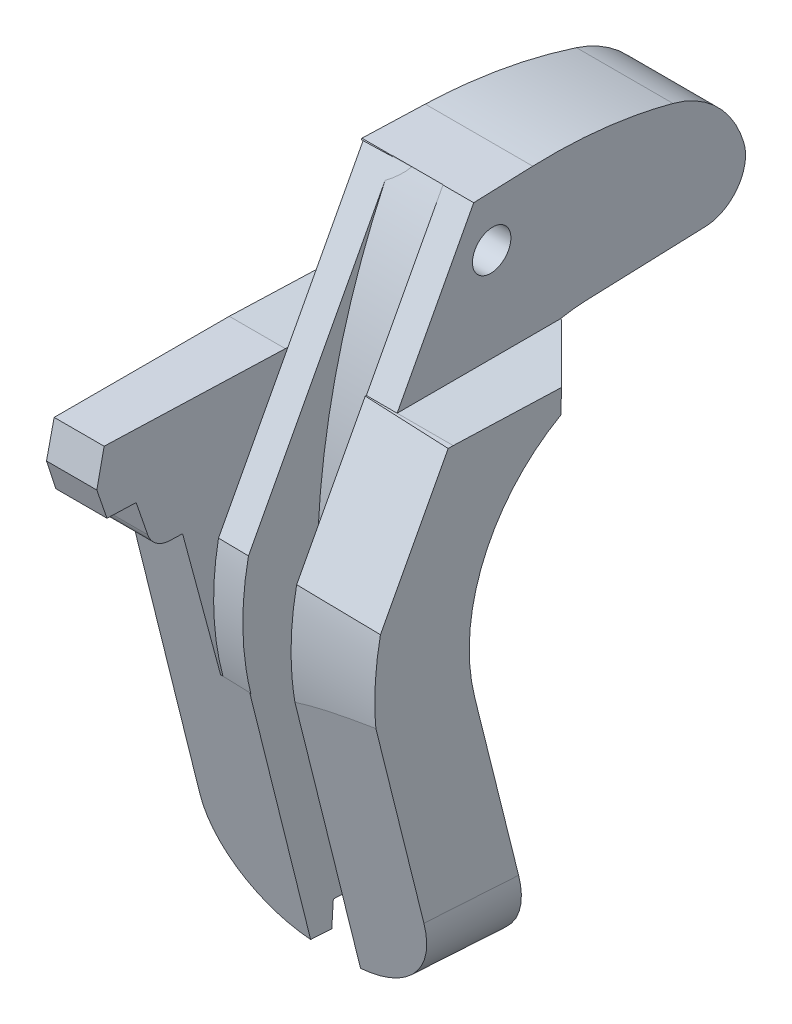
ISO-10303-21;
HEADER;
FILE_DESCRIPTION(('STEP AP214'),'2;1');
FILE_NAME('part.step','',(''),(''),'','','');
FILE_SCHEMA(('AUTOMOTIVE_DESIGN { 1 0 10303 214 1 1 1 1 }'));
ENDSEC;
DATA;
#1=APPLICATION_CONTEXT('core data for automotive mechanical design processes');
#2=APPLICATION_PROTOCOL_DEFINITION('international standard','automotive_design',2000,#1);
#3=PRODUCT_CONTEXT('',#1,'mechanical');
#4=PRODUCT('Part','Part','',(#3));
#5=PRODUCT_RELATED_PRODUCT_CATEGORY('part','',(#4));
#6=PRODUCT_DEFINITION_FORMATION('','',#4);
#7=PRODUCT_DEFINITION_CONTEXT('part definition',#1,'design');
#8=PRODUCT_DEFINITION('design','',#6,#7);
#9=PRODUCT_DEFINITION_SHAPE('','',#8);
#10=(LENGTH_UNIT() NAMED_UNIT(*) SI_UNIT(.MILLI.,.METRE.));
#11=(NAMED_UNIT(*) PLANE_ANGLE_UNIT() SI_UNIT($,.RADIAN.));
#12=(NAMED_UNIT(*) SI_UNIT($,.STERADIAN.) SOLID_ANGLE_UNIT());
#13=UNCERTAINTY_MEASURE_WITH_UNIT(LENGTH_MEASURE(1.E-05),#10,'distance_accuracy_value','');
#14=(GEOMETRIC_REPRESENTATION_CONTEXT(3) GLOBAL_UNCERTAINTY_ASSIGNED_CONTEXT((#13)) GLOBAL_UNIT_ASSIGNED_CONTEXT((#10,
#11,#12)) REPRESENTATION_CONTEXT('',''));
#15=CARTESIAN_POINT('',(0.,0.,0.));
#16=DIRECTION('',(0.,0.,1.));
#17=DIRECTION('',(1.,0.,0.));
#18=AXIS2_PLACEMENT_3D('',#15,#16,#17);
#19=CARTESIAN_POINT('',(7.8613,-27.2526814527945,10.6132381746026));
#20=DIRECTION('',(0.,0.241921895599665,-0.970295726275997));
#21=DIRECTION('',(0.,0.970295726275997,0.241921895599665));
#22=AXIS2_PLACEMENT_3D('',#19,#20,#21);
#23=PLANE('',#22);
#24=DIRECTION('',(0.,-0.970295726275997,-0.241921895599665));
#25=VECTOR('',#24,1.);
#26=CARTESIAN_POINT('',(-7.8613,-27.2526814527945,10.6132381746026));
#27=LINE('',#26,#25);
#28=CARTESIAN_POINT('',(-7.8613,-14.224,13.8616533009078));
#29=VERTEX_POINT('',#28);
#30=CARTESIAN_POINT('',(-7.8613,-34.4895699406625,8.80887922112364));
#31=VERTEX_POINT('',#30);
#32=EDGE_CURVE('E340',#29,#31,#27,.T.);
#33=ORIENTED_EDGE('',*,*,#32,.T.);
#34=CARTESIAN_POINT('',(-1.0033,-34.4895699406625,8.80887922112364));
#35=DIRECTION('',(0.,0.241921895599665,-0.970295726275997));
#36=DIRECTION('',(0.,-0.970295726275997,-0.241921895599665));
#37=AXIS2_PLACEMENT_3D('',#34,#35,#36);
#38=CIRCLE('',#37,6.858);
#39=CARTESIAN_POINT('',(-1.7399,-41.1053635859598,7.1593766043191));
#40=VERTEX_POINT('',#39);
#41=EDGE_CURVE('E410',#40,#31,#38,.T.);
#42=ORIENTED_EDGE('',*,*,#41,.F.);
#43=DIRECTION('',(0.,-0.970295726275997,-0.241921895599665));
#44=VECTOR('',#43,1.);
#45=CARTESIAN_POINT('',(-1.7399,-27.2526814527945,10.6132381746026));
#46=LINE('',#45,#44);
#47=CARTESIAN_POINT('',(-1.7399,-23.9561599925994,11.4351532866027));
#48=VERTEX_POINT('',#47);
#49=EDGE_CURVE('E417',#48,#40,#46,.T.);
#50=ORIENTED_EDGE('',*,*,#49,.F.);
#51=DIRECTION('',(-0.998916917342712,0.0451473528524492,0.0112564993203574));
#52=VECTOR('',#51,1.);
#53=CARTESIAN_POINT('',(7.99842336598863,-24.3962962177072,11.3254150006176));
#54=LINE('',#53,#52);
#55=CARTESIAN_POINT('',(-3.76575726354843,-23.8645987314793,11.4579820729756));
#56=VERTEX_POINT('',#55);
#57=EDGE_CURVE('E399',#48,#56,#54,.T.);
#58=ORIENTED_EDGE('',*,*,#57,.T.);
#59=DIRECTION('',(-0.0264595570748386,0.969956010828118,0.24183719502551));
#60=VECTOR('',#59,1.);
#61=CARTESIAN_POINT('',(-3.66525782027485,-27.5487132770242,10.5394291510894));
#62=LINE('',#61,#60);
#63=CARTESIAN_POINT('',(-4.02874441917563,-14.224,13.8616533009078));
#64=VERTEX_POINT('',#63);
#65=EDGE_CURVE('E490',#56,#64,#62,.T.);
#66=ORIENTED_EDGE('',*,*,#65,.T.);
#67=DIRECTION('',(-1.,0.,0.));
#68=VECTOR('',#67,1.);
#69=CARTESIAN_POINT('',(7.8613,-14.224,13.8616533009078));
#70=LINE('',#69,#68);
#71=EDGE_CURVE('E358',#64,#29,#70,.T.);
#72=ORIENTED_EDGE('',*,*,#71,.T.);
#73=EDGE_LOOP('',(#33,#42,#50,#58,#66,#72));
#74=FACE_BOUND('',#73,.T.);
#75=ADVANCED_FACE('F32',(#74),#23,.F.);
#76=CARTESIAN_POINT('',(7.8613,3.63220000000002,-39.961643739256));
#77=DIRECTION('',(0.,1.,0.));
#78=DIRECTION('',(0.,0.,1.));
#79=AXIS2_PLACEMENT_3D('',#76,#77,#78);
#80=PLANE('',#79);
#81=DIRECTION('',(-1.,0.,0.));
#82=VECTOR('',#81,1.);
#83=CARTESIAN_POINT('',(7.8613,3.6322,1.37696212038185));
#84=LINE('',#83,#82);
#85=CARTESIAN_POINT('',(-1.7399,3.6322,1.37696212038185));
#86=VERTEX_POINT('',#85);
#87=CARTESIAN_POINT('',(-3.9243,3.6322,1.37696212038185));
#88=VERTEX_POINT('',#87);
#89=EDGE_CURVE('E376',#86,#88,#84,.T.);
#90=ORIENTED_EDGE('',*,*,#89,.F.);
#91=DIRECTION('',(0.,0.,-1.));
#92=VECTOR('',#91,1.);
#93=CARTESIAN_POINT('',(-1.7399,3.63220000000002,-39.961643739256));
#94=LINE('',#93,#92);
#95=CARTESIAN_POINT('',(-1.7399,3.6322,1.35775177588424));
#96=VERTEX_POINT('',#95);
#97=EDGE_CURVE('E440',#86,#96,#94,.T.);
#98=ORIENTED_EDGE('',*,*,#97,.T.);
#99=DIRECTION('',(1.,0.,0.));
#100=VECTOR('',#99,1.);
#101=CARTESIAN_POINT('',(-1.7399,3.6322,1.35775177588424));
#102=LINE('',#101,#100);
#103=CARTESIAN_POINT('',(1.7653,3.6322,1.35775177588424));
#104=VERTEX_POINT('',#103);
#105=EDGE_CURVE('E448',#104,#96,#102,.F.);
#106=ORIENTED_EDGE('',*,*,#105,.F.);
#107=DIRECTION('',(0.,0.,-1.));
#108=VECTOR('',#107,1.);
#109=CARTESIAN_POINT('',(1.7653,3.63220000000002,-39.961643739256));
#110=LINE('',#109,#108);
#111=CARTESIAN_POINT('',(1.7653,3.6322,1.37696212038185));
#112=VERTEX_POINT('',#111);
#113=EDGE_CURVE('E777',#112,#104,#110,.T.);
#114=ORIENTED_EDGE('',*,*,#113,.F.);
#115=CARTESIAN_POINT('',(3.9243,3.6322,1.37696212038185));
#116=VERTEX_POINT('',#115);
#117=EDGE_CURVE('E377',#116,#112,#84,.T.);
#118=ORIENTED_EDGE('',*,*,#117,.F.);
#119=DIRECTION('',(0.0349055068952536,0.,0.999390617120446));
#120=VECTOR('',#119,1.);
#121=CARTESIAN_POINT('',(2.48703113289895,3.63220000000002,-39.7739377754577));
#122=LINE('',#121,#120);
#123=CARTESIAN_POINT('',(3.77424903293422,3.6322,-2.91919461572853));
#124=VERTEX_POINT('',#123);
#125=EDGE_CURVE('E534',#124,#116,#122,.T.);
#126=ORIENTED_EDGE('',*,*,#125,.F.);
#127=DIRECTION('',(-1.,0.,0.));
#128=VECTOR('',#127,1.);
#129=CARTESIAN_POINT('',(7.8613,3.6322,-2.91919461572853));
#130=LINE('',#129,#128);
#131=CARTESIAN_POINT('',(-3.77424903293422,3.6322,-2.91919461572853));
#132=VERTEX_POINT('',#131);
#133=EDGE_CURVE('E380',#124,#132,#130,.T.);
#134=ORIENTED_EDGE('',*,*,#133,.T.);
#135=DIRECTION('',(0.0349055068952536,0.,-0.999390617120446));
#136=VECTOR('',#135,1.);
#137=CARTESIAN_POINT('',(-2.4678748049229,3.63220000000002,-40.3224086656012));
#138=LINE('',#137,#136);
#139=EDGE_CURVE('E563',#88,#132,#138,.T.);
#140=ORIENTED_EDGE('',*,*,#139,.F.);
#141=EDGE_LOOP('',(#90,#98,#106,#114,#118,#126,#134,#140));
#142=FACE_BOUND('',#141,.T.);
#143=ADVANCED_FACE('F587',(#142),#80,.T.);
#144=CARTESIAN_POINT('',(7.8613,6.5205888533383,-0.158821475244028));
#145=DIRECTION('',(0.,-0.469471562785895,-0.882947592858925));
#146=DIRECTION('',(0.,0.882947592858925,-0.469471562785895));
#147=AXIS2_PLACEMENT_3D('',#144,#145,#146);
#148=PLANE('',#147);
#149=DIRECTION('',(0.,-0.882947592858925,0.469471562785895));
#150=VECTOR('',#149,1.);
#151=CARTESIAN_POINT('',(-1.7399,6.5205888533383,-0.158821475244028));
#152=LINE('',#151,#150);
#153=CARTESIAN_POINT('',(-1.7399,3.59988848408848,1.39414245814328));
#154=VERTEX_POINT('',#153);
#155=EDGE_CURVE('E438',#86,#154,#152,.T.);
#156=ORIENTED_EDGE('',*,*,#155,.F.);
#157=ORIENTED_EDGE('',*,*,#89,.T.);
#158=DIRECTION('',(0.,0.882947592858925,-0.469471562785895));
#159=VECTOR('',#158,1.);
#160=CARTESIAN_POINT('',(-3.9243,-6.477,6.75211910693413));
#161=LINE('',#160,#159);
#162=CARTESIAN_POINT('',(-3.9243,3.55932220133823,1.41571193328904));
#163=VERTEX_POINT('',#162);
#164=EDGE_CURVE('E539',#163,#88,#161,.T.);
#165=ORIENTED_EDGE('',*,*,#164,.F.);
#166=DIRECTION('',(0.999778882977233,0.0185667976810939,-0.00987214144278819));
#167=VECTOR('',#166,1.);
#168=CARTESIAN_POINT('',(7.9265982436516,3.77940409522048,1.29869231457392));
#169=LINE('',#168,#167);
#170=EDGE_CURVE('E498',#163,#154,#169,.T.);
#171=ORIENTED_EDGE('',*,*,#170,.T.);
#172=EDGE_LOOP('',(#156,#157,#165,#171));
#173=FACE_BOUND('',#172,.T.);
#174=ADVANCED_FACE('F592',(#173),#148,.F.);
#175=CARTESIAN_POINT('',(7.8613,-11.9610458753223,3.887054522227));
#176=DIRECTION('',(0.,-0.0610485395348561,-0.998134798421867));
#177=DIRECTION('',(0.,0.998134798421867,-0.0610485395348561));
#178=AXIS2_PLACEMENT_3D('',#175,#176,#177);
#179=PLANE('',#178);
#180=CARTESIAN_POINT('',(-5.73196309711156,-39.4338726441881,5.56736459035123));
#181=CARTESIAN_POINT('',(-5.58957805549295,-39.5629329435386,5.57525825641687));
#182=CARTESIAN_POINT('',(-5.4416438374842,-39.6858625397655,5.58277695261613));
#183=CARTESIAN_POINT('',(-5.13601730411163,-39.9187168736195,5.59701893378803));
#184=CARTESIAN_POINT('',(-4.97833278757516,-40.0286518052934,5.60374284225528));
#185=CARTESIAN_POINT('',(-4.6543306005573,-40.2349706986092,5.61636184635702));
#186=CARTESIAN_POINT('',(-4.48801364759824,-40.3313557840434,5.6222570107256));
#187=CARTESIAN_POINT('',(-4.14787138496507,-40.5101226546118,5.63319086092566));
#188=CARTESIAN_POINT('',(-3.97404193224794,-40.5924965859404,5.63822906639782));
#189=CARTESIAN_POINT('',(-3.63383506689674,-40.736962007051,5.64706495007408));
#190=CARTESIAN_POINT('',(-3.46791353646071,-40.8001264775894,5.65092825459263));
#191=CARTESIAN_POINT('',(-3.13172297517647,-40.9138630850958,5.65788468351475));
#192=CARTESIAN_POINT('',(-2.96145234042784,-40.964430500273,5.66097751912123));
#193=CARTESIAN_POINT('',(-2.61722094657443,-41.0528295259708,5.66638423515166));
#194=CARTESIAN_POINT('',(-2.44325277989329,-41.0906323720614,5.6686963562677));
#195=CARTESIAN_POINT('',(-2.09304804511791,-41.153194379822,5.67252281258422));
#196=CARTESIAN_POINT('',(-1.91681239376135,-41.1779586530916,5.67403746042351));
#197=CARTESIAN_POINT('',(-1.7399,-41.196142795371,5.6751496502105));
#198=B_SPLINE_CURVE_WITH_KNOTS('',3,(#180,#181,#182,#183,#184,#185,#186,#187,#188,#189,#190,
#191,#192,#193,#194,#195,#196,#197),.UNSPECIFIED.,.F.,.F.,(4,2,2,2,2,2,2,2,4),(0.,
0.576795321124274,1.15313511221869,1.72942707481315,2.30604101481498,2.83828391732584,
3.37072602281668,3.90436007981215,4.43778477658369),.UNSPECIFIED.);
#199=CARTESIAN_POINT('',(-5.73196309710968,-39.4338726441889,5.56736459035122));
#200=VERTEX_POINT('',#199);
#201=CARTESIAN_POINT('',(-1.7399,-41.196142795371,5.67514965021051));
#202=VERTEX_POINT('',#201);
#203=EDGE_CURVE('E54',#200,#202,#198,.T.);
#204=ORIENTED_EDGE('',*,*,#203,.F.);
#205=DIRECTION('',(-1.,0.,0.));
#206=VECTOR('',#205,1.);
#207=CARTESIAN_POINT('',(7.8613,-39.4338726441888,5.56736459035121));
#208=LINE('',#207,#206);
#209=CARTESIAN_POINT('',(-1.7399,-39.4338726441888,5.56736459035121));
#210=VERTEX_POINT('',#209);
#211=EDGE_CURVE('E355',#210,#200,#208,.T.);
#212=ORIENTED_EDGE('',*,*,#211,.F.);
#213=DIRECTION('',(0.,-0.998134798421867,0.0610485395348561));
#214=VECTOR('',#213,1.);
#215=CARTESIAN_POINT('',(-1.7399,-11.9610458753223,3.887054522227));
#216=LINE('',#215,#214);
#217=EDGE_CURVE('E426',#210,#202,#216,.T.);
#218=ORIENTED_EDGE('',*,*,#217,.T.);
#219=EDGE_LOOP('',(#204,#212,#218));
#220=FACE_BOUND('',#219,.T.);
#221=ADVANCED_FACE('F754',(#220),#179,.T.);
#222=CARTESIAN_POINT('',(7.8613,-42.1157739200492,-38.2813336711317));
#223=DIRECTION('',(0.,-0.998134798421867,0.0610485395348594));
#224=DIRECTION('',(0.,-0.0610485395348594,-0.998134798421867));
#225=AXIS2_PLACEMENT_3D('',#222,#223,#224);
#226=PLANE('',#225);
#227=DIRECTION('',(0.,0.0610485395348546,0.998134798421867));
#228=VECTOR('',#227,1.);
#229=CARTESIAN_POINT('',(5.73196309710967,-41.0008614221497,-20.0526754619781));
#230=LINE('',#229,#228);
#231=CARTESIAN_POINT('',(5.73196309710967,-39.4338726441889,5.56736459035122));
#232=VERTEX_POINT('',#231);
#233=CARTESIAN_POINT('',(5.73196309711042,-39.7155798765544,0.961492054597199));
#234=VERTEX_POINT('',#233);
#235=EDGE_CURVE('E737',#232,#234,#230,.F.);
#236=ORIENTED_EDGE('',*,*,#235,.F.);
#237=CARTESIAN_POINT('',(1.7653,-39.4338726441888,5.56736459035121));
#238=VERTEX_POINT('',#237);
#239=EDGE_CURVE('E356',#232,#238,#208,.T.);
#240=ORIENTED_EDGE('',*,*,#239,.T.);
#241=DIRECTION('',(0.,0.0610485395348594,0.998134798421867));
#242=VECTOR('',#241,1.);
#243=CARTESIAN_POINT('',(1.7653,-42.1157739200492,-38.2813336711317));
#244=LINE('',#243,#242);
#245=CARTESIAN_POINT('',(1.7653,-39.630838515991,2.34700105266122));
#246=VERTEX_POINT('',#245);
#247=EDGE_CURVE('E782',#246,#238,#244,.T.);
#248=ORIENTED_EDGE('',*,*,#247,.F.);
#249=DIRECTION('',(1.,0.,0.));
#250=VECTOR('',#249,1.);
#251=CARTESIAN_POINT('',(-1.7399,-39.630838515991,2.34700105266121));
#252=LINE('',#251,#250);
#253=CARTESIAN_POINT('',(-1.7399,-39.630838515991,2.34700105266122));
#254=VERTEX_POINT('',#253);
#255=EDGE_CURVE('E446',#254,#246,#252,.T.);
#256=ORIENTED_EDGE('',*,*,#255,.F.);
#257=DIRECTION('',(0.,0.0610485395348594,0.998134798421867));
#258=VECTOR('',#257,1.);
#259=CARTESIAN_POINT('',(-1.7399,-42.1157739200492,-38.2813336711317));
#260=LINE('',#259,#258);
#261=EDGE_CURVE('E428',#254,#210,#260,.T.);
#262=ORIENTED_EDGE('',*,*,#261,.T.);
#263=ORIENTED_EDGE('',*,*,#211,.T.);
#264=DIRECTION('',(0.,0.0610485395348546,0.998134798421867));
#265=VECTOR('',#264,1.);
#266=CARTESIAN_POINT('',(-5.73196309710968,-41.0008614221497,-20.0526754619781));
#267=LINE('',#266,#265);
#268=CARTESIAN_POINT('',(-5.73196309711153,-39.715579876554,0.961492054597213));
#269=VERTEX_POINT('',#268);
#270=EDGE_CURVE('E762',#269,#200,#267,.T.);
#271=ORIENTED_EDGE('',*,*,#270,.F.);
#272=DIRECTION('',(-1.,0.,0.));
#273=VECTOR('',#272,1.);
#274=CARTESIAN_POINT('',(7.8613,-39.7155798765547,0.961492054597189));
#275=LINE('',#274,#273);
#276=EDGE_CURVE('E353',#234,#269,#275,.T.);
#277=ORIENTED_EDGE('',*,*,#276,.F.);
#278=EDGE_LOOP('',(#236,#240,#248,#256,#262,#263,#271,#277));
#279=FACE_BOUND('',#278,.T.);
#280=ADVANCED_FACE('F721',(#279),#226,.T.);
#281=CARTESIAN_POINT('',(13.5320380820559,-59.7833443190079,-14.1915413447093));
#282=DIRECTION('',(-0.0173870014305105,-0.586581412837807,0.809703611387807));
#283=DIRECTION('',(0.,-0.809826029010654,-0.586670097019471));
#284=AXIS2_PLACEMENT_3D('',#281,#282,#283);
#285=PLANE('',#284);
#286=DIRECTION('',(0.,0.809826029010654,0.586670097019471));
#287=VECTOR('',#286,1.);
#288=CARTESIAN_POINT('',(-1.7399,-59.6275403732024,-14.4066095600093));
#289=LINE('',#288,#287);
#290=CARTESIAN_POINT('',(-1.7399,-24.0671085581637,11.354777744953));
#291=VERTEX_POINT('',#290);
#292=EDGE_CURVE('E425',#291,#48,#289,.T.);
#293=ORIENTED_EDGE('',*,*,#292,.F.);
#294=DIRECTION('',(-0.999218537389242,-0.018556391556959,-0.034899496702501));
#295=VECTOR('',#294,1.);
#296=CARTESIAN_POINT('',(11.9550750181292,-23.8127804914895,11.8330992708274));
#297=LINE('',#296,#295);
#298=CARTESIAN_POINT('',(-3.75523835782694,-24.104535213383,11.2843884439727));
#299=VERTEX_POINT('',#298);
#300=EDGE_CURVE('E462',#291,#299,#297,.T.);
#301=ORIENTED_EDGE('',*,*,#300,.T.);
#302=DIRECTION('',(-0.0354965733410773,0.809677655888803,0.585800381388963));
#303=VECTOR('',#302,1.);
#304=CARTESIAN_POINT('',(-2.17827529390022,-60.0750990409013,-14.7402521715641));
#305=LINE('',#304,#303);
#306=EDGE_CURVE('E453',#299,#56,#305,.T.);
#307=ORIENTED_EDGE('',*,*,#306,.T.);
#308=ORIENTED_EDGE('',*,*,#57,.F.);
#309=EDGE_LOOP('',(#293,#301,#307,#308));
#310=FACE_BOUND('',#309,.T.);
#311=ADVANCED_FACE('F668',(#310),#285,.F.);
#312=CARTESIAN_POINT('',(12.5145968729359,-19.2081475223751,-6.63507484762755));
#313=DIRECTION('',(-0.999218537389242,-0.018556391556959,-0.034899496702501));
#314=DIRECTION('',(-0.0349055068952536,0.,0.999390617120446));
#315=AXIS2_PLACEMENT_3D('',#312,#313,#314);
#316=CYLINDRICAL_SURFACE('',#315,19.0417742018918);
#317=ORIENTED_EDGE('',*,*,#300,.F.);
#318=CARTESIAN_POINT('',(-1.7399,-19.4728664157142,-7.13293867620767));
#319=DIRECTION('',(1.,0.,0.));
#320=DIRECTION('',(0.,-0.469471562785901,-0.882947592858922));
#321=AXIS2_PLACEMENT_3D('',#318,#319,#320);
#322=ELLIPSE('',#321,19.0566662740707,19.0417742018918);
#323=CARTESIAN_POINT('',(-1.7399,-15.5996557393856,11.5247717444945));
#324=VERTEX_POINT('',#323);
#325=EDGE_CURVE('E430',#291,#324,#322,.F.);
#326=ORIENTED_EDGE('',*,*,#325,.T.);
#327=DIRECTION('',(-0.999218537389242,-0.018556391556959,-0.034899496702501));
#328=VECTOR('',#327,1.);
#329=CARTESIAN_POINT('',(11.7921443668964,-15.3483534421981,11.9974026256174));
#330=LINE('',#329,#328);
#331=CARTESIAN_POINT('',(-3.91816900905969,-15.6401081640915,11.4486917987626));
#332=VERTEX_POINT('',#331);
#333=EDGE_CURVE('E467',#324,#332,#330,.T.);
#334=ORIENTED_EDGE('',*,*,#333,.T.);
#335=CARTESIAN_POINT('',(-3.19571650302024,-19.4999022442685,-7.18378567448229));
#336=DIRECTION('',(-0.999218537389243,-0.018556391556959,-0.034899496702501));
#337=DIRECTION('',(-0.0349055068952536,0.,0.999390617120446));
#338=AXIS2_PLACEMENT_3D('',#335,#336,#337);
#339=CIRCLE('',#338,19.0417742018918);
#340=EDGE_CURVE('E450',#299,#332,#339,.T.);
#341=ORIENTED_EDGE('',*,*,#340,.F.);
#342=EDGE_LOOP('',(#317,#326,#334,#341));
#343=FACE_BOUND('',#342,.T.);
#344=ADVANCED_FACE('F673',(#343),#316,.T.);
#345=CARTESIAN_POINT('',(11.7921443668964,-56.4430106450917,33.8478194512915));
#346=DIRECTION('',(0.0395261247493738,-0.469104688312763,-0.882257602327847));
#347=DIRECTION('',(0.,0.882947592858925,-0.469471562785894));
#348=AXIS2_PLACEMENT_3D('',#345,#346,#347);
#349=PLANE('',#348);
#350=DIRECTION('',(0.,-0.882947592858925,0.469471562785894));
#351=VECTOR('',#350,1.);
#352=CARTESIAN_POINT('',(-1.7399,-56.6943129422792,33.3751885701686));
#353=LINE('',#352,#351);
#354=CARTESIAN_POINT('',(-1.7399,2.43280194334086,1.93674391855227));
#355=VERTEX_POINT('',#354);
#356=EDGE_CURVE('E404',#355,#324,#353,.T.);
#357=ORIENTED_EDGE('',*,*,#356,.F.);
#358=CARTESIAN_POINT('',(-1284.22156285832,-19.05,-44.0972567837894));
#359=DIRECTION('',(0.0395261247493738,-0.469104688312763,-0.882257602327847));
#360=DIRECTION('',(0.999218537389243,0.0185563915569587,0.0348994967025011));
#361=AXIS2_PLACEMENT_3D('',#358,#359,#360);
#362=ELLIPSE('',#361,1285.22591886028,50.8);
#363=CARTESIAN_POINT('',(-0.43470506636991,3.62412713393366,1.36177926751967));
#364=VERTEX_POINT('',#363);
#365=EDGE_CURVE('E406',#355,#364,#362,.F.);
#366=ORIENTED_EDGE('',*,*,#365,.T.);
#367=DIRECTION('',(-0.999218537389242,-0.018556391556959,-0.034899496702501));
#368=VECTOR('',#367,1.);
#369=CARTESIAN_POINT('',(11.7921443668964,3.85119078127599,1.78882387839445));
#370=LINE('',#369,#368);
#371=CARTESIAN_POINT('',(-3.91816900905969,3.55943605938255,1.24011305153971));
#372=VERTEX_POINT('',#371);
#373=EDGE_CURVE('E468',#364,#372,#370,.T.);
#374=ORIENTED_EDGE('',*,*,#373,.T.);
#375=DIRECTION('',(0.,-0.882947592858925,0.469471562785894));
#376=VECTOR('',#375,1.);
#377=CARTESIAN_POINT('',(-3.91816900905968,-56.7347653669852,33.2991086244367));
#378=LINE('',#377,#376);
#379=CARTESIAN_POINT('',(-3.91816900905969,-6.48301819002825,6.5797806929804));
#380=VERTEX_POINT('',#379);
#381=EDGE_CURVE('E460',#372,#380,#378,.T.);
#382=ORIENTED_EDGE('',*,*,#381,.T.);
#383=EDGE_CURVE('E459',#380,#332,#378,.T.);
#384=ORIENTED_EDGE('',*,*,#383,.T.);
#385=ORIENTED_EDGE('',*,*,#333,.F.);
#386=EDGE_LOOP('',(#357,#366,#374,#382,#384,#385));
#387=FACE_BOUND('',#386,.T.);
#388=ADVANCED_FACE('F612',(#387),#349,.F.);
#389=ORIENTED_EDGE('',*,*,#117,.T.);
#390=DIRECTION('',(0.,-0.882947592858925,0.469471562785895));
#391=VECTOR('',#390,1.);
#392=CARTESIAN_POINT('',(1.7653,6.5205888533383,-0.158821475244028));
#393=LINE('',#392,#391);
#394=CARTESIAN_POINT('',(1.7653,-6.477,6.75211910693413));
#395=VERTEX_POINT('',#394);
#396=EDGE_CURVE('E774',#112,#395,#393,.T.);
#397=ORIENTED_EDGE('',*,*,#396,.T.);
#398=DIRECTION('',(-1.,0.,0.));
#399=VECTOR('',#398,1.);
#400=CARTESIAN_POINT('',(7.8613,-6.477,6.75211910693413));
#401=LINE('',#400,#399);
#402=CARTESIAN_POINT('',(3.9243,-6.477,6.75211910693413));
#403=VERTEX_POINT('',#402);
#404=EDGE_CURVE('E372',#403,#395,#401,.T.);
#405=ORIENTED_EDGE('',*,*,#404,.F.);
#406=DIRECTION('',(0.,-0.882947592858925,0.469471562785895));
#407=VECTOR('',#406,1.);
#408=CARTESIAN_POINT('',(3.9243,-6.477,6.75211910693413));
#409=LINE('',#408,#407);
#410=EDGE_CURVE('E516',#116,#403,#409,.T.);
#411=ORIENTED_EDGE('',*,*,#410,.F.);
#412=EDGE_LOOP('',(#389,#397,#405,#411));
#413=FACE_BOUND('',#412,.T.);
#414=ADVANCED_FACE('F605',(#413),#148,.F.);
#415=CARTESIAN_POINT('',(7.8613,-6.47699999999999,-39.961643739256));
#416=DIRECTION('',(0.,1.,0.));
#417=DIRECTION('',(0.,0.,1.));
#418=AXIS2_PLACEMENT_3D('',#415,#416,#417);
#419=PLANE('',#418);
#420=DIRECTION('',(0.,0.,-1.));
#421=VECTOR('',#420,1.);
#422=CARTESIAN_POINT('',(1.7653,-6.47699999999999,-39.961643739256));
#423=LINE('',#422,#421);
#424=CARTESIAN_POINT('',(1.7653,-6.47699999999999,6.83120651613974));
#425=VERTEX_POINT('',#424);
#426=EDGE_CURVE('E772',#425,#395,#423,.T.);
#427=ORIENTED_EDGE('',*,*,#426,.F.);
#428=DIRECTION('',(-0.998997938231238,0.,-0.044756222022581));
#429=VECTOR('',#428,1.);
#430=CARTESIAN_POINT('',(5.75691637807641,-6.477,7.01003538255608));
#431=LINE('',#430,#429);
#432=CARTESIAN_POINT('',(7.8613,-6.477,7.10431411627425));
#433=VERTEX_POINT('',#432);
#434=EDGE_CURVE('E495',#433,#425,#431,.T.);
#435=ORIENTED_EDGE('',*,*,#434,.F.);
#436=DIRECTION('',(0.,0.,-1.));
#437=VECTOR('',#436,1.);
#438=CARTESIAN_POINT('',(7.8613,-6.47699999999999,-39.961643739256));
#439=LINE('',#438,#437);
#440=CARTESIAN_POINT('',(7.8613,-6.477,6.75211910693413));
#441=VERTEX_POINT('',#440);
#442=EDGE_CURVE('E308',#433,#441,#439,.T.);
#443=ORIENTED_EDGE('',*,*,#442,.T.);
#444=EDGE_CURVE('E373',#441,#403,#401,.T.);
#445=ORIENTED_EDGE('',*,*,#444,.T.);
#446=ORIENTED_EDGE('',*,*,#404,.T.);
#447=EDGE_LOOP('',(#427,#435,#443,#445,#446));
#448=FACE_BOUND('',#447,.T.);
#449=ADVANCED_FACE('F598',(#448),#419,.T.);
#450=DIRECTION('',(0.,-0.970295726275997,-0.241921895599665));
#451=VECTOR('',#450,1.);
#452=CARTESIAN_POINT('',(1.7653,-27.2526814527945,10.6132381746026));
#453=LINE('',#452,#451);
#454=CARTESIAN_POINT('',(1.76530000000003,-22.6261941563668,11.7667510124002));
#455=VERTEX_POINT('',#454);
#456=CARTESIAN_POINT('',(1.7653,-41.1026546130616,7.16005202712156));
#457=VERTEX_POINT('',#456);
#458=EDGE_CURVE('E301',#455,#457,#453,.T.);
#459=ORIENTED_EDGE('',*,*,#458,.T.);
#460=CARTESIAN_POINT('',(1.0033,-34.4895699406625,8.80887922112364));
#461=DIRECTION('',(0.,0.241921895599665,-0.970295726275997));
#462=DIRECTION('',(0.,-0.970295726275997,-0.241921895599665));
#463=AXIS2_PLACEMENT_3D('',#460,#461,#462);
#464=CIRCLE('',#463,6.858);
#465=CARTESIAN_POINT('',(7.8613,-34.4895699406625,8.80887922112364));
#466=VERTEX_POINT('',#465);
#467=EDGE_CURVE('E47',#466,#457,#464,.T.);
#468=ORIENTED_EDGE('',*,*,#467,.F.);
#469=DIRECTION('',(0.,-0.970295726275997,-0.241921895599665));
#470=VECTOR('',#469,1.);
#471=CARTESIAN_POINT('',(7.8613,-27.2526814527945,10.6132381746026));
#472=LINE('',#471,#470);
#473=CARTESIAN_POINT('',(7.8613,-20.9629158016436,12.1814528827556));
#474=VERTEX_POINT('',#473);
#475=EDGE_CURVE('E300',#474,#466,#472,.T.);
#476=ORIENTED_EDGE('',*,*,#475,.F.);
#477=CARTESIAN_POINT('',(648.033962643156,-7.40597837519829,15.5615770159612));
#478=DIRECTION('',(0.,0.241921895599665,-0.970295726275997));
#479=DIRECTION('',(-0.999649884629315,-0.0256735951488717,-0.00640114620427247));
#480=AXIS2_PLACEMENT_3D('',#477,#478,#479);
#481=ELLIPSE('',#480,648.260732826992,19.0417742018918);
#482=EDGE_CURVE('E501',#455,#474,#481,.T.);
#483=ORIENTED_EDGE('',*,*,#482,.F.);
#484=EDGE_LOOP('',(#459,#468,#476,#483));
#485=FACE_BOUND('',#484,.T.);
#486=ADVANCED_FACE('F298',(#485),#23,.F.);
#487=CARTESIAN_POINT('',(7.8613,-14.6429471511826,-39.961643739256));
#488=DIRECTION('',(1.,0.,0.));
#489=DIRECTION('',(0.,0.,-1.));
#490=AXIS2_PLACEMENT_3D('',#487,#488,#489);
#491=PLANE('',#490);
#492=DIRECTION('',(0.,0.0610485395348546,0.998134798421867));
#493=VECTOR('',#492,1.);
#494=CARTESIAN_POINT('',(7.8613,-36.1813224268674,-18.8510294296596));
#495=LINE('',#494,#493);
#496=CARTESIAN_POINT('',(7.8613,-34.8960408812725,2.1631380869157));
#497=VERTEX_POINT('',#496);
#498=EDGE_CURVE('E286',#497,#466,#495,.T.);
#499=ORIENTED_EDGE('',*,*,#498,.F.);
#500=DIRECTION('',(0.,-0.970295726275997,-0.241921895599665));
#501=VECTOR('',#500,1.);
#502=CARTESIAN_POINT('',(7.8613,-25.7164774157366,4.45186031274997));
#503=LINE('',#502,#501);
#504=CARTESIAN_POINT('',(7.8613,-22.5129629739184,5.25058617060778));
#505=VERTEX_POINT('',#504);
#506=EDGE_CURVE('E307',#505,#497,#503,.T.);
#507=ORIENTED_EDGE('',*,*,#506,.F.);
#508=CARTESIAN_POINT('',(7.8613,-19.4405548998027,-7.07216955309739));
#509=DIRECTION('',(1.,0.,0.));
#510=DIRECTION('',(0.,0.,-1.));
#511=AXIS2_PLACEMENT_3D('',#508,#509,#510);
#512=CIRCLE('',#511,12.7);
#513=CARTESIAN_POINT('',(7.8613,-8.39844585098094,-0.798269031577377));
#514=VERTEX_POINT('',#513);
#515=EDGE_CURVE('E310',#514,#505,#512,.T.);
#516=ORIENTED_EDGE('',*,*,#515,.F.);
#517=DIRECTION('',(0.,0.999390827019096,-0.034899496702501));
#518=VECTOR('',#517,1.);
#519=CARTESIAN_POINT('',(7.8613,-22.4557067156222,-0.307378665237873));
#520=LINE('',#519,#518);
#521=CARTESIAN_POINT('',(7.8613,-6.74268449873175,-0.856089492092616));
#522=VERTEX_POINT('',#521);
#523=EDGE_CURVE('E505',#514,#522,#520,.T.);
#524=ORIENTED_EDGE('',*,*,#523,.T.);
#525=DIRECTION('',(0.,-0.034899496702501,-0.999390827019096));
#526=VECTOR('',#525,1.);
#527=CARTESIAN_POINT('',(7.8613,-8.11623960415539,-40.1895613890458));
#528=LINE('',#527,#526);
#529=EDGE_CURVE('E392',#441,#522,#528,.T.);
#530=ORIENTED_EDGE('',*,*,#529,.F.);
#531=ORIENTED_EDGE('',*,*,#442,.F.);
#532=DIRECTION('',(0.,0.882947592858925,-0.469471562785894));
#533=VECTOR('',#532,1.);
#534=CARTESIAN_POINT('',(7.8613,6.66658030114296,0.115748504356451));
#535=LINE('',#534,#533);
#536=CARTESIAN_POINT('',(7.8613,-15.4213527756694,11.8601108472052));
#537=VERTEX_POINT('',#536);
#538=EDGE_CURVE('E493',#537,#433,#535,.T.);
#539=ORIENTED_EDGE('',*,*,#538,.F.);
#540=CARTESIAN_POINT('',(7.8613,-19.294563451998,-6.79759957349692));
#541=DIRECTION('',(1.,0.,0.));
#542=DIRECTION('',(0.,-0.469471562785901,-0.882947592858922));
#543=AXIS2_PLACEMENT_3D('',#540,#541,#542);
#544=ELLIPSE('',#543,19.0566662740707,19.0417742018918);
#545=EDGE_CURVE('E306',#537,#474,#544,.T.);
#546=ORIENTED_EDGE('',*,*,#545,.T.);
#547=ORIENTED_EDGE('',*,*,#475,.T.);
#548=EDGE_LOOP('',(#499,#507,#516,#524,#530,#531,#539,#546,#547));
#549=FACE_BOUND('',#548,.T.);
#550=ADVANCED_FACE('F304',(#549),#491,.T.);
#551=CARTESIAN_POINT('',(7.8613,-3.89581809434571,-15.697263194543));
#552=DIRECTION('',(-1.,0.,0.));
#553=DIRECTION('',(0.,0.,1.));
#554=AXIS2_PLACEMENT_3D('',#551,#552,#553);
#555=CYLINDRICAL_SURFACE('',#554,2.84473680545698);
#556=DIRECTION('',(-1.,0.,0.));
#557=VECTOR('',#556,1.);
#558=CARTESIAN_POINT('',(7.8613,-3.04166632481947,-18.4107392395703));
#559=LINE('',#558,#557);
#560=CARTESIAN_POINT('',(3.10923936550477,-3.04166632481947,-18.4107392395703));
#561=VERTEX_POINT('',#560);
#562=CARTESIAN_POINT('',(-3.10923936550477,-3.04166632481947,-18.4107392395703));
#563=VERTEX_POINT('',#562);
#564=EDGE_CURVE('E384',#561,#563,#559,.T.);
#565=ORIENTED_EDGE('',*,*,#564,.F.);
#566=CARTESIAN_POINT('',(3.18815000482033,-3.89581809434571,-15.697263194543));
#567=DIRECTION('',(-0.999218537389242,0.0185563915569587,0.034899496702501));
#568=DIRECTION('',(-0.0395261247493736,-0.469104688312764,-0.882257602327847));
#569=AXIS2_PLACEMENT_3D('',#566,#567,#568);
#570=ELLIPSE('',#569,2.84696159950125,2.84473680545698);
#571=CARTESIAN_POINT('',(3.13532067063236,-6.74055489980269,-15.697263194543));
#572=VERTEX_POINT('',#571);
#573=EDGE_CURVE('E525',#561,#572,#570,.T.);
#574=ORIENTED_EDGE('',*,*,#573,.T.);
#575=DIRECTION('',(-1.,0.,0.));
#576=VECTOR('',#575,1.);
#577=CARTESIAN_POINT('',(7.8613,-6.74055489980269,-15.697263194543));
#578=LINE('',#577,#576);
#579=CARTESIAN_POINT('',(-3.13532067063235,-6.74055489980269,-15.697263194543));
#580=VERTEX_POINT('',#579);
#581=EDGE_CURVE('E317',#572,#580,#578,.T.);
#582=ORIENTED_EDGE('',*,*,#581,.T.);
#583=CARTESIAN_POINT('',(-3.18815000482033,-3.89581809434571,-15.697263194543));
#584=DIRECTION('',(0.999218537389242,0.018556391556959,0.034899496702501));
#585=DIRECTION('',(-0.0395261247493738,0.46910468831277,0.882257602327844));
#586=AXIS2_PLACEMENT_3D('',#583,#584,#585);
#587=ELLIPSE('',#586,2.84696159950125,2.84473680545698);
#588=EDGE_CURVE('E554',#580,#563,#587,.T.);
#589=ORIENTED_EDGE('',*,*,#588,.T.);
#590=EDGE_LOOP('',(#565,#574,#582,#589));
#591=FACE_BOUND('',#590,.T.);
#592=ADVANCED_FACE('F603',(#591),#555,.T.);
#593=CARTESIAN_POINT('',(7.8613,-5.40588892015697,-10.900058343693));
#594=DIRECTION('',(-1.,0.,0.));
#595=DIRECTION('',(0.,0.,1.));
#596=AXIS2_PLACEMENT_3D('',#593,#594,#595);
#597=CYLINDRICAL_SURFACE('',#596,7.874);
#598=DIRECTION('',(-1.,0.,0.));
#599=VECTOR('',#598,1.);
#600=CARTESIAN_POINT('',(7.8613,2.14004965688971,-13.1492108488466));
#601=LINE('',#600,#599);
#602=CARTESIAN_POINT('',(3.38923681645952,2.14004965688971,-13.1492108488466));
#603=VERTEX_POINT('',#602);
#604=CARTESIAN_POINT('',(-3.38923681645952,2.14004965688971,-13.1492108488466));
#605=VERTEX_POINT('',#604);
#606=EDGE_CURVE('E382',#603,#605,#601,.T.);
#607=ORIENTED_EDGE('',*,*,#606,.F.);
#608=CARTESIAN_POINT('',(3.32765759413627,-5.40588892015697,-10.900058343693));
#609=DIRECTION('',(-0.999218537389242,0.0185563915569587,0.034899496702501));
#610=DIRECTION('',(-0.0395261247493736,-0.469104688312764,-0.882257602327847));
#611=AXIS2_PLACEMENT_3D('',#608,#609,#610);
#612=ELLIPSE('',#611,7.88015804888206,7.874);
#613=EDGE_CURVE('E528',#603,#561,#612,.T.);
#614=ORIENTED_EDGE('',*,*,#613,.T.);
#615=ORIENTED_EDGE('',*,*,#564,.T.);
#616=CARTESIAN_POINT('',(-3.32765759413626,-5.40588892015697,-10.900058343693));
#617=DIRECTION('',(0.999218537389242,0.018556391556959,0.034899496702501));
#618=DIRECTION('',(-0.0395261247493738,0.46910468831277,0.882257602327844));
#619=AXIS2_PLACEMENT_3D('',#616,#617,#618);
#620=ELLIPSE('',#619,7.88015804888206,7.874);
#621=EDGE_CURVE('E557',#563,#605,#620,.T.);
#622=ORIENTED_EDGE('',*,*,#621,.T.);
#623=EDGE_LOOP('',(#607,#614,#615,#622));
#624=FACE_BOUND('',#623,.T.);
#625=ADVANCED_FACE('F627',(#624),#597,.T.);
#626=CARTESIAN_POINT('',(7.8613,-32.1818,-2.91919461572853));
#627=DIRECTION('',(-1.,0.,0.));
#628=DIRECTION('',(0.,0.,1.));
#629=AXIS2_PLACEMENT_3D('',#626,#627,#628);
#630=CYLINDRICAL_SURFACE('',#629,35.814);
#631=ORIENTED_EDGE('',*,*,#133,.F.);
#632=CARTESIAN_POINT('',(3.10915067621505,-32.1818,-2.91919461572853));
#633=DIRECTION('',(-0.999218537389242,0.0185563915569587,0.034899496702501));
#634=DIRECTION('',(-0.0395261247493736,-0.469104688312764,-0.882257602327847));
#635=AXIS2_PLACEMENT_3D('',#632,#633,#634);
#636=ELLIPSE('',#635,35.8420091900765,35.814);
#637=EDGE_CURVE('E531',#124,#603,#636,.T.);
#638=ORIENTED_EDGE('',*,*,#637,.T.);
#639=ORIENTED_EDGE('',*,*,#606,.T.);
#640=CARTESIAN_POINT('',(-3.10915067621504,-32.1818,-2.91919461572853));
#641=DIRECTION('',(0.999218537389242,0.018556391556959,0.034899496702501));
#642=DIRECTION('',(-0.0395261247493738,0.46910468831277,0.882257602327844));
#643=AXIS2_PLACEMENT_3D('',#640,#641,#642);
#644=ELLIPSE('',#643,35.8420091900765,35.814);
#645=EDGE_CURVE('E560',#605,#132,#644,.T.);
#646=ORIENTED_EDGE('',*,*,#645,.T.);
#647=EDGE_LOOP('',(#631,#638,#639,#646));
#648=FACE_BOUND('',#647,.T.);
#649=ADVANCED_FACE('F619',(#648),#630,.T.);
#650=DIRECTION('',(-0.0349055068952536,0.,0.999390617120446));
#651=VECTOR('',#650,1.);
#652=CARTESIAN_POINT('',(-2.28036655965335,-6.47699999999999,-40.3158596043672));
#653=LINE('',#652,#651);
#654=CARTESIAN_POINT('',(-3.9243,-6.477,6.75211910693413));
#655=VERTEX_POINT('',#654);
#656=CARTESIAN_POINT('',(-4.35361731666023,-6.477,19.0440390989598));
#657=VERTEX_POINT('',#656);
#658=EDGE_CURVE('E466',#655,#657,#653,.T.);
#659=ORIENTED_EDGE('',*,*,#658,.F.);
#660=DIRECTION('',(1.,0.,0.));
#661=VECTOR('',#660,1.);
#662=CARTESIAN_POINT('',(-3.9243,-6.477,6.75211910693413));
#663=LINE('',#662,#661);
#664=CARTESIAN_POINT('',(-7.8613,-6.477,6.75211910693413));
#665=VERTEX_POINT('',#664);
#666=EDGE_CURVE('E542',#665,#655,#663,.T.);
#667=ORIENTED_EDGE('',*,*,#666,.F.);
#668=DIRECTION('',(0.,0.,-1.));
#669=VECTOR('',#668,1.);
#670=CARTESIAN_POINT('',(-7.8613,-6.47699999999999,-39.961643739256));
#671=LINE('',#670,#669);
#672=CARTESIAN_POINT('',(-7.8613,-6.477,19.0440390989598));
#673=VERTEX_POINT('',#672);
#674=EDGE_CURVE('E318',#673,#665,#671,.T.);
#675=ORIENTED_EDGE('',*,*,#674,.F.);
#676=DIRECTION('',(-1.,0.,0.));
#677=VECTOR('',#676,1.);
#678=CARTESIAN_POINT('',(7.8613,-6.477,19.0440390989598));
#679=LINE('',#678,#677);
#680=EDGE_CURVE('E370',#657,#673,#679,.T.);
#681=ORIENTED_EDGE('',*,*,#680,.F.);
#682=EDGE_LOOP('',(#659,#667,#675,#681));
#683=FACE_BOUND('',#682,.T.);
#684=ADVANCED_FACE('F608',(#683),#419,.T.);
#685=CARTESIAN_POINT('',(7.8613,-1.54390482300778,17.9277936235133));
#686=DIRECTION('',(0.,-0.220697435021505,-0.975342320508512));
#687=DIRECTION('',(0.,0.975342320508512,-0.220697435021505));
#688=AXIS2_PLACEMENT_3D('',#685,#686,#687);
#689=PLANE('',#688);
#690=DIRECTION('',(-1.,0.,0.));
#691=VECTOR('',#690,1.);
#692=CARTESIAN_POINT('',(7.8613,-8.85756838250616,19.5827067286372));
#693=LINE('',#692,#691);
#694=CARTESIAN_POINT('',(-4.32822194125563,-8.85756838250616,19.5827067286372));
#695=VERTEX_POINT('',#694);
#696=CARTESIAN_POINT('',(-7.8613,-8.85756838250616,19.5827067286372));
#697=VERTEX_POINT('',#696);
#698=EDGE_CURVE('E368',#695,#697,#693,.T.);
#699=ORIENTED_EDGE('',*,*,#698,.F.);
#700=DIRECTION('',(-0.0104041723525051,0.975289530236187,-0.220685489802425));
#701=VECTOR('',#700,1.);
#702=CARTESIAN_POINT('',(-4.40491455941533,-1.66838456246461,17.9559605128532));
#703=LINE('',#702,#701);
#704=EDGE_CURVE('E472',#695,#657,#703,.T.);
#705=ORIENTED_EDGE('',*,*,#704,.T.);
#706=ORIENTED_EDGE('',*,*,#680,.T.);
#707=DIRECTION('',(0.,-0.975342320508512,0.220697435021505));
#708=VECTOR('',#707,1.);
#709=CARTESIAN_POINT('',(-7.8613,-1.54390482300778,17.9277936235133));
#710=LINE('',#709,#708);
#711=EDGE_CURVE('E321',#673,#697,#710,.T.);
#712=ORIENTED_EDGE('',*,*,#711,.T.);
#713=EDGE_LOOP('',(#699,#705,#706,#712));
#714=FACE_BOUND('',#713,.T.);
#715=ADVANCED_FACE('F618',(#714),#689,.F.);
#716=CARTESIAN_POINT('',(7.8613,-31.5901381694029,12.1964470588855));
#717=DIRECTION('',(0.,0.309016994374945,-0.951056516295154));
#718=DIRECTION('',(0.,0.951056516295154,0.309016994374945));
#719=AXIS2_PLACEMENT_3D('',#716,#717,#718);
#720=PLANE('',#719);
#721=DIRECTION('',(-1.,0.,0.));
#722=VECTOR('',#721,1.);
#723=CARTESIAN_POINT('',(7.8613,-10.8712,18.9284381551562));
#724=LINE('',#723,#722);
#725=CARTESIAN_POINT('',(-4.26797548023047,-10.8712,18.9284381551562));
#726=VERTEX_POINT('',#725);
#727=CARTESIAN_POINT('',(-7.8613,-10.8712,18.9284381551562));
#728=VERTEX_POINT('',#727);
#729=EDGE_CURVE('E366',#726,#728,#724,.T.);
#730=ORIENTED_EDGE('',*,*,#729,.F.);
#731=DIRECTION('',(-0.0284434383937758,0.950671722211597,0.308891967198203));
#732=VECTOR('',#731,1.);
#733=CARTESIAN_POINT('',(-3.63876780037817,-31.9013560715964,12.0953262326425));
#734=LINE('',#733,#732);
#735=EDGE_CURVE('E475',#726,#695,#734,.T.);
#736=ORIENTED_EDGE('',*,*,#735,.T.);
#737=ORIENTED_EDGE('',*,*,#698,.T.);
#738=DIRECTION('',(0.,-0.951056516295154,-0.309016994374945));
#739=VECTOR('',#738,1.);
#740=CARTESIAN_POINT('',(-7.8613,-31.5901381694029,12.1964470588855));
#741=LINE('',#740,#739);
#742=EDGE_CURVE('E325',#697,#728,#741,.T.);
#743=ORIENTED_EDGE('',*,*,#742,.T.);
#744=EDGE_LOOP('',(#730,#736,#737,#743));
#745=FACE_BOUND('',#744,.T.);
#746=ADVANCED_FACE('F625',(#745),#720,.F.);
#747=CARTESIAN_POINT('',(7.8613,-10.8712,-39.961643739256));
#748=DIRECTION('',(0.,1.,0.));
#749=DIRECTION('',(0.,0.,1.));
#750=AXIS2_PLACEMENT_3D('',#747,#748,#749);
#751=PLANE('',#750);
#752=DIRECTION('',(-1.,0.,0.));
#753=VECTOR('',#752,1.);
#754=CARTESIAN_POINT('',(7.8613,-10.8712,16.9521097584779));
#755=LINE('',#754,#753);
#756=CARTESIAN_POINT('',(-4.19894867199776,-10.8712,16.9521097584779));
#757=VERTEX_POINT('',#756);
#758=CARTESIAN_POINT('',(-7.8613,-10.8712,16.9521097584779));
#759=VERTEX_POINT('',#758);
#760=EDGE_CURVE('E364',#757,#759,#755,.T.);
#761=ORIENTED_EDGE('',*,*,#760,.F.);
#762=DIRECTION('',(-0.0349055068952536,0.,0.999390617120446));
#763=VECTOR('',#762,1.);
#764=CARTESIAN_POINT('',(-2.19886171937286,-10.8712,-40.3130129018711));
#765=LINE('',#764,#763);
#766=EDGE_CURVE('E478',#757,#726,#765,.T.);
#767=ORIENTED_EDGE('',*,*,#766,.T.);
#768=ORIENTED_EDGE('',*,*,#729,.T.);
#769=DIRECTION('',(0.,0.,-1.));
#770=VECTOR('',#769,1.);
#771=CARTESIAN_POINT('',(-7.8613,-10.8712,-39.961643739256));
#772=LINE('',#771,#770);
#773=EDGE_CURVE('E328',#728,#759,#772,.T.);
#774=ORIENTED_EDGE('',*,*,#773,.T.);
#775=EDGE_LOOP('',(#761,#767,#768,#774));
#776=FACE_BOUND('',#775,.T.);
#777=ADVANCED_FACE('F653',(#776),#751,.F.);
#778=CARTESIAN_POINT('',(7.8613,-31.0093098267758,10.408841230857));
#779=DIRECTION('',(0.,0.309016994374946,-0.951056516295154));
#780=DIRECTION('',(0.,0.951056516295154,0.309016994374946));
#781=AXIS2_PLACEMENT_3D('',#778,#779,#780);
#782=PLANE('',#781);
#783=DIRECTION('',(-1.,0.,0.));
#784=VECTOR('',#783,1.);
#785=CARTESIAN_POINT('',(7.8613,-13.1709418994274,16.2048783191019));
#786=LINE('',#785,#784);
#787=CARTESIAN_POINT('',(-4.13014198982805,-13.1709418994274,16.2048783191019));
#788=VERTEX_POINT('',#787);
#789=CARTESIAN_POINT('',(-7.8613,-13.1709418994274,16.2048783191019));
#790=VERTEX_POINT('',#789);
#791=EDGE_CURVE('E362',#788,#790,#786,.T.);
#792=ORIENTED_EDGE('',*,*,#791,.F.);
#793=DIRECTION('',(-0.0284434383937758,0.950671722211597,0.308891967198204));
#794=VECTOR('',#793,1.);
#795=CARTESIAN_POINT('',(-3.58716075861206,-31.3191311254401,10.3081741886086));
#796=LINE('',#795,#794);
#797=EDGE_CURVE('E481',#788,#757,#796,.T.);
#798=ORIENTED_EDGE('',*,*,#797,.T.);
#799=ORIENTED_EDGE('',*,*,#760,.T.);
#800=DIRECTION('',(0.,-0.951056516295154,-0.309016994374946));
#801=VECTOR('',#800,1.);
#802=CARTESIAN_POINT('',(-7.8613,-31.0093098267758,10.408841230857));
#803=LINE('',#802,#801);
#804=EDGE_CURVE('E331',#759,#790,#803,.T.);
#805=ORIENTED_EDGE('',*,*,#804,.T.);
#806=EDGE_LOOP('',(#792,#798,#799,#805));
#807=FACE_BOUND('',#806,.T.);
#808=ADVANCED_FACE('F657',(#807),#782,.F.);
#809=CARTESIAN_POINT('',(7.8613,-12.7,14.7554681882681));
#810=DIRECTION('',(-1.,0.,0.));
#811=DIRECTION('',(0.,0.,1.));
#812=AXIS2_PLACEMENT_3D('',#809,#810,#811);
#813=CYLINDRICAL_SURFACE('',#812,1.524);
#814=DIRECTION('',(-1.,0.,0.));
#815=VECTOR('',#814,1.);
#816=CARTESIAN_POINT('',(7.8613,-14.224,14.755468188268));
#817=LINE('',#816,#815);
#818=CARTESIAN_POINT('',(-4.05996250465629,-14.224,14.755468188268));
#819=VERTEX_POINT('',#818);
#820=CARTESIAN_POINT('',(-7.8613,-14.224,14.755468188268));
#821=VERTEX_POINT('',#820);
#822=EDGE_CURVE('E360',#819,#821,#817,.T.);
#823=ORIENTED_EDGE('',*,*,#822,.F.);
#824=CARTESIAN_POINT('',(-4.08826456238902,-12.7,14.7554681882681));
#825=DIRECTION('',(-0.999218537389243,-0.018556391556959,-0.034899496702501));
#826=DIRECTION('',(-0.0395261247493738,0.46910468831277,0.882257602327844));
#827=AXIS2_PLACEMENT_3D('',#824,#825,#826);
#828=ELLIPSE('',#827,1.52519188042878,1.524);
#829=EDGE_CURVE('E484',#819,#788,#828,.T.);
#830=ORIENTED_EDGE('',*,*,#829,.T.);
#831=ORIENTED_EDGE('',*,*,#791,.T.);
#832=CARTESIAN_POINT('',(-7.8613,-12.7,14.7554681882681));
#833=DIRECTION('',(1.,0.,0.));
#834=DIRECTION('',(0.,0.,-1.));
#835=AXIS2_PLACEMENT_3D('',#832,#833,#834);
#836=CIRCLE('',#835,1.524);
#837=EDGE_CURVE('E334',#790,#821,#836,.T.);
#838=ORIENTED_EDGE('',*,*,#837,.T.);
#839=EDGE_LOOP('',(#823,#830,#831,#838));
#840=FACE_BOUND('',#839,.T.);
#841=ADVANCED_FACE('F661',(#840),#813,.T.);
#842=CARTESIAN_POINT('',(7.8613,-14.224,-39.961643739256));
#843=DIRECTION('',(0.,1.,0.));
#844=DIRECTION('',(0.,0.,1.));
#845=AXIS2_PLACEMENT_3D('',#842,#843,#844);
#846=PLANE('',#845);
#847=ORIENTED_EDGE('',*,*,#71,.F.);
#848=DIRECTION('',(-0.0349055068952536,0.,0.999390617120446));
#849=VECTOR('',#848,1.);
#850=CARTESIAN_POINT('',(-2.1366730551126,-14.224,-40.3108408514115));
#851=LINE('',#850,#849);
#852=EDGE_CURVE('E487',#64,#819,#851,.T.);
#853=ORIENTED_EDGE('',*,*,#852,.T.);
#854=ORIENTED_EDGE('',*,*,#822,.T.);
#855=DIRECTION('',(0.,0.,-1.));
#856=VECTOR('',#855,1.);
#857=CARTESIAN_POINT('',(-7.8613,-14.224,-39.961643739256));
#858=LINE('',#857,#856);
#859=EDGE_CURVE('E337',#821,#29,#858,.T.);
#860=ORIENTED_EDGE('',*,*,#859,.T.);
#861=EDGE_LOOP('',(#847,#853,#854,#860));
#862=FACE_BOUND('',#861,.T.);
#863=ADVANCED_FACE('F666',(#862),#846,.F.);
#864=CARTESIAN_POINT('',(1.7653,-41.1934850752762,5.67498709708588));
#865=CARTESIAN_POINT('',(1.95999522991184,-41.17277814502,5.67372060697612));
#866=CARTESIAN_POINT('',(2.15384297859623,-41.1440922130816,5.67196610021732));
#867=CARTESIAN_POINT('',(2.53849863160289,-41.0709683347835,5.66749365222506));
#868=CARTESIAN_POINT('',(2.72930704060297,-41.0265330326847,5.66477587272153));
#869=CARTESIAN_POINT('',(3.10652994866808,-40.9221301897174,5.65839032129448));
#870=CARTESIAN_POINT('',(3.29294617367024,-40.8621688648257,5.65472292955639));
#871=CARTESIAN_POINT('',(3.66019098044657,-40.7269944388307,5.64645530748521));
#872=CARTESIAN_POINT('',(3.84101857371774,-40.6517786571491,5.64185491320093));
#873=CARTESIAN_POINT('',(4.17397787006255,-40.4966342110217,5.63236587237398));
#874=CARTESIAN_POINT('',(4.32691055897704,-40.4184126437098,5.62758163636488));
#875=CARTESIAN_POINT('',(4.6265918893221,-40.2508430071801,5.61733263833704));
#876=CARTESIAN_POINT('',(4.77333887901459,-40.1614919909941,5.61186769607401));
#877=CARTESIAN_POINT('',(5.06018405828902,-39.9717611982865,5.60026326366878));
#878=CARTESIAN_POINT('',(5.20025911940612,-39.8713465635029,5.59412164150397));
#879=CARTESIAN_POINT('',(5.47236086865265,-39.6602165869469,5.58120837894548));
#880=CARTESIAN_POINT('',(5.60438841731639,-39.5495023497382,5.57443680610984));
#881=CARTESIAN_POINT('',(5.73196309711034,-39.4338726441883,5.56736459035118));
#882=B_SPLINE_CURVE_WITH_KNOTS('',3,(#864,#865,#866,#867,#868,#869,#870,#871,#872,#873,#874,
#875,#876,#877,#878,#879,#880,#881),.UNSPECIFIED.,.F.,.F.,(4,2,2,2,2,2,2,2,4),(0.,
0.58723593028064,1.1743733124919,1.76127599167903,2.3482818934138,2.86335263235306,
3.3785600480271,3.89543984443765,4.41226427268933),.UNSPECIFIED.);
#883=CARTESIAN_POINT('',(1.7653,-41.1934850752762,5.67498709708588));
#884=VERTEX_POINT('',#883);
#885=EDGE_CURVE('E421',#884,#232,#882,.T.);
#886=ORIENTED_EDGE('',*,*,#885,.F.);
#887=DIRECTION('',(0.,-0.998134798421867,0.0610485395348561));
#888=VECTOR('',#887,1.);
#889=CARTESIAN_POINT('',(1.7653,-11.9610458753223,3.887054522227));
#890=LINE('',#889,#888);
#891=EDGE_CURVE('E779',#238,#884,#890,.T.);
#892=ORIENTED_EDGE('',*,*,#891,.F.);
#893=ORIENTED_EDGE('',*,*,#239,.F.);
#894=EDGE_LOOP('',(#886,#892,#893));
#895=FACE_BOUND('',#894,.T.);
#896=ADVANCED_FACE('F719',(#895),#179,.T.);
#897=CARTESIAN_POINT('',(7.8613,-25.7164774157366,4.45186031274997));
#898=DIRECTION('',(0.,0.241921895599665,-0.970295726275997));
#899=DIRECTION('',(0.,0.970295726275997,0.241921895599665));
#900=AXIS2_PLACEMENT_3D('',#897,#898,#899);
#901=PLANE('',#900);
#902=CARTESIAN_POINT('',(5.73196309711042,-39.7155798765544,0.961492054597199));
#903=CARTESIAN_POINT('',(5.86961758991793,-39.5884516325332,0.993188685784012));
#904=CARTESIAN_POINT('',(6.00179710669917,-39.4557471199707,1.02627563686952));
#905=CARTESIAN_POINT('',(6.25436564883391,-39.1801487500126,1.09499002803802));
#906=CARTESIAN_POINT('',(6.37475391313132,-39.0372542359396,1.13061763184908));
#907=CARTESIAN_POINT('',(6.60288432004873,-38.7422519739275,1.20416995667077));
#908=CARTESIAN_POINT('',(6.71062614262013,-38.5901439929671,1.24209473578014));
#909=CARTESIAN_POINT('',(6.91270890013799,-38.2777905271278,1.319973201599));
#910=CARTESIAN_POINT('',(7.00705137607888,-38.1175459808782,1.3599266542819));
#911=CARTESIAN_POINT('',(7.18168909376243,-37.7900249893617,1.44158680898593));
#912=CARTESIAN_POINT('',(7.26198561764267,-37.62274918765,1.48329335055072));
#913=CARTESIAN_POINT('',(7.40801064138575,-37.2822525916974,1.56818868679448));
#914=CARTESIAN_POINT('',(7.47373479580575,-37.1090300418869,1.61137791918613));
#915=CARTESIAN_POINT('',(7.58628668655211,-36.7694830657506,1.69603648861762));
#916=CARTESIAN_POINT('',(7.63407510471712,-36.6034576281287,1.73743127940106));
#917=CARTESIAN_POINT('',(7.71625072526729,-36.2682450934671,1.82100915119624));
#918=CARTESIAN_POINT('',(7.75063294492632,-36.099056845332,1.86319251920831));
#919=CARTESIAN_POINT('',(7.80584396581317,-35.7580667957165,1.94821088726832));
#920=CARTESIAN_POINT('',(7.82662984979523,-35.5862584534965,1.99104751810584));
#921=CARTESIAN_POINT('',(7.85436322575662,-35.2416475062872,2.07696867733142));
#922=CARTESIAN_POINT('',(7.86131501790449,-35.0688452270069,2.12005312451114));
#923=CARTESIAN_POINT('',(7.8613,-34.8960408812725,2.1631380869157));
#924=B_SPLINE_CURVE_WITH_KNOTS('',3,(#902,#903,#904,#905,#906,#907,#908,#909,#910,#911,#912,
#913,#914,#915,#916,#917,#918,#919,#920,#921,#922,#923),.UNSPECIFIED.,.F.,.F.,(4,2,2,2,2,2,2,2,
2,2,4),(0.,0.569949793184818,1.13993634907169,1.70993732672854,2.27987269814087,
2.84975601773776,3.41980904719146,3.95224902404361,4.48488670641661,5.01919766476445,
5.55334251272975),.UNSPECIFIED.);
#925=EDGE_CURVE('E289',#234,#497,#924,.T.);
#926=ORIENTED_EDGE('',*,*,#925,.F.);
#927=ORIENTED_EDGE('',*,*,#276,.T.);
#928=CARTESIAN_POINT('',(-7.8613,-34.8960408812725,2.1631380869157));
#929=CARTESIAN_POINT('',(-7.86131955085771,-35.0804473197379,2.11716039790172));
#930=CARTESIAN_POINT('',(-7.85340062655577,-35.2648510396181,2.07118338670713));
#931=CARTESIAN_POINT('',(-7.82182730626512,-35.6323743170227,1.97954954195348));
#932=CARTESIAN_POINT('',(-7.79817392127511,-35.8154939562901,1.93389268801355));
#933=CARTESIAN_POINT('',(-7.73527225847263,-36.1791993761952,1.84321074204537));
#934=CARTESIAN_POINT('',(-7.69602355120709,-36.3597850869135,1.79818566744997));
#935=CARTESIAN_POINT('',(-7.60220789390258,-36.7171725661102,1.7090789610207));
#936=CARTESIAN_POINT('',(-7.54764080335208,-36.8939742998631,1.66499733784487));
#937=CARTESIAN_POINT('',(-7.42356388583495,-37.2425713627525,1.57808232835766));
#938=CARTESIAN_POINT('',(-7.35405391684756,-37.4143666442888,1.53524895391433));
#939=CARTESIAN_POINT('',(-7.20057173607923,-37.7517615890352,1.45112694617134));
#940=CARTESIAN_POINT('',(-7.11659993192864,-37.9173614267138,1.40983826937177));
#941=CARTESIAN_POINT('',(-6.94164942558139,-38.2289802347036,1.33214297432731));
#942=CARTESIAN_POINT('',(-6.8516791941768,-38.3755333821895,1.29560317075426));
#943=CARTESIAN_POINT('',(-6.66041313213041,-38.6615005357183,1.22430355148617));
#944=CARTESIAN_POINT('',(-6.55911787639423,-38.8009149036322,1.18954364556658));
#945=CARTESIAN_POINT('',(-6.34316774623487,-39.0751167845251,1.1211774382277));
#946=CARTESIAN_POINT('',(-6.22824557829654,-39.2097061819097,1.08762053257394));
#947=CARTESIAN_POINT('',(-5.9878407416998,-39.4697253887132,1.02279046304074));
#948=CARTESIAN_POINT('',(-5.86235657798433,-39.5951538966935,0.991517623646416));
#949=CARTESIAN_POINT('',(-5.73196309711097,-39.7155798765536,0.961492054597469));
#950=B_SPLINE_CURVE_WITH_KNOTS('',3,(#928,#929,#930,#931,#932,#933,#934,#935,#936,#937,#938,
#939,#940,#941,#942,#943,#944,#945,#946,#947,#948,#949),.UNSPECIFIED.,.F.,.F.,(4,2,2,2,2,2,2,2,
2,2,4),(0.,0.569986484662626,1.13993634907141,1.70990190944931,2.27987269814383,
2.84984890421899,3.41980904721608,3.94671433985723,4.47359289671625,5.01342931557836,
5.55334227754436),.UNSPECIFIED.);
#951=CARTESIAN_POINT('',(-7.8613,-34.8960408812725,2.16313808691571));
#952=VERTEX_POINT('',#951);
#953=EDGE_CURVE('E724',#952,#269,#950,.T.);
#954=ORIENTED_EDGE('',*,*,#953,.F.);
#955=DIRECTION('',(0.,-0.970295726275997,-0.241921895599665));
#956=VECTOR('',#955,1.);
#957=CARTESIAN_POINT('',(-7.8613,-25.7164774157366,4.45186031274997));
#958=LINE('',#957,#956);
#959=CARTESIAN_POINT('',(-7.8613,-22.5129629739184,5.25058617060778));
#960=VERTEX_POINT('',#959);
#961=EDGE_CURVE('E343',#960,#952,#958,.T.);
#962=ORIENTED_EDGE('',*,*,#961,.F.);
#963=DIRECTION('',(-1.,0.,0.));
#964=VECTOR('',#963,1.);
#965=CARTESIAN_POINT('',(7.8613,-22.5129629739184,5.25058617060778));
#966=LINE('',#965,#964);
#967=EDGE_CURVE('E350',#505,#960,#966,.T.);
#968=ORIENTED_EDGE('',*,*,#967,.F.);
#969=ORIENTED_EDGE('',*,*,#506,.T.);
#970=EDGE_LOOP('',(#926,#927,#954,#962,#968,#969));
#971=FACE_BOUND('',#970,.T.);
#972=ADVANCED_FACE('F582',(#971),#901,.T.);
#973=CARTESIAN_POINT('',(7.8613,-19.4405548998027,-7.07216955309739));
#974=DIRECTION('',(-1.,0.,0.));
#975=DIRECTION('',(0.,0.,1.));
#976=AXIS2_PLACEMENT_3D('',#973,#974,#975);
#977=CYLINDRICAL_SURFACE('',#976,12.7);
#978=CARTESIAN_POINT('',(1.20585732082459,-19.4405548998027,-7.07216955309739));
#979=DIRECTION('',(-0.707106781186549,0.024677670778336,0.706676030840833));
#980=DIRECTION('',(-0.707106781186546,-0.0246776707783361,-0.706676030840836));
#981=AXIS2_PLACEMENT_3D('',#978,#979,#980);
#982=ELLIPSE('',#981,17.9605122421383,12.7);
#983=CARTESIAN_POINT('',(3.59528260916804,-6.8915663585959,-5.11950814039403));
#984=VERTEX_POINT('',#983);
#985=EDGE_CURVE('E508',#514,#984,#982,.T.);
#986=ORIENTED_EDGE('',*,*,#985,.F.);
#987=ORIENTED_EDGE('',*,*,#515,.T.);
#988=ORIENTED_EDGE('',*,*,#967,.T.);
#989=CARTESIAN_POINT('',(-7.8613,-19.4405548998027,-7.07216955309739));
#990=DIRECTION('',(1.,0.,0.));
#991=DIRECTION('',(0.,0.,-1.));
#992=AXIS2_PLACEMENT_3D('',#989,#990,#991);
#993=CIRCLE('',#992,12.7);
#994=CARTESIAN_POINT('',(-7.8613,-8.39844585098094,-0.798269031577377));
#995=VERTEX_POINT('',#994);
#996=EDGE_CURVE('E312',#995,#960,#993,.T.);
#997=ORIENTED_EDGE('',*,*,#996,.F.);
#998=CARTESIAN_POINT('',(-1.20585732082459,-19.4405548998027,-7.07216955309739));
#999=DIRECTION('',(0.707106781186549,0.024677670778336,0.706676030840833));
#1000=DIRECTION('',(-0.707106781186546,0.0246776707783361,0.706676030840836));
#1001=AXIS2_PLACEMENT_3D('',#998,#999,#1000);
#1002=ELLIPSE('',#1001,17.9605122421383,12.7);
#1003=CARTESIAN_POINT('',(-3.59528260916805,-6.8915663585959,-5.11950814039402));
#1004=VERTEX_POINT('',#1003);
#1005=EDGE_CURVE('E514',#1004,#995,#1002,.T.);
#1006=ORIENTED_EDGE('',*,*,#1005,.F.);
#1007=DIRECTION('',(-1.,0.,0.));
#1008=VECTOR('',#1007,1.);
#1009=CARTESIAN_POINT('',(7.8613,-6.8915663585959,-5.11950814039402));
#1010=LINE('',#1009,#1008);
#1011=CARTESIAN_POINT('',(-3.50196328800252,-6.8915663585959,-5.11950814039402));
#1012=VERTEX_POINT('',#1011);
#1013=EDGE_CURVE('E549',#1012,#1004,#1010,.T.);
#1014=ORIENTED_EDGE('',*,*,#1013,.F.);
#1015=CARTESIAN_POINT('',(-3.20071702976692,-19.4405548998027,-7.07216955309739));
#1016=DIRECTION('',(0.999218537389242,0.018556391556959,0.034899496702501));
#1017=DIRECTION('',(-0.0395261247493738,0.46910468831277,0.882257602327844));
#1018=AXIS2_PLACEMENT_3D('',#1015,#1016,#1017);
#1019=ELLIPSE('',#1018,12.7099323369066,12.7);
#1020=CARTESIAN_POINT('',(-3.43656751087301,-6.74055489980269,-7.0721695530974));
#1021=VERTEX_POINT('',#1020);
#1022=EDGE_CURVE('E552',#1021,#1012,#1019,.T.);
#1023=ORIENTED_EDGE('',*,*,#1022,.F.);
#1024=DIRECTION('',(-1.,0.,0.));
#1025=VECTOR('',#1024,1.);
#1026=CARTESIAN_POINT('',(7.8613,-6.74055489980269,-7.07216955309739));
#1027=LINE('',#1026,#1025);
#1028=CARTESIAN_POINT('',(3.43656751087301,-6.74055489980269,-7.0721695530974));
#1029=VERTEX_POINT('',#1028);
#1030=EDGE_CURVE('E348',#1029,#1021,#1027,.T.);
#1031=ORIENTED_EDGE('',*,*,#1030,.F.);
#1032=CARTESIAN_POINT('',(3.20071702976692,-19.4405548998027,-7.07216955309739));
#1033=DIRECTION('',(-0.999218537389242,0.0185563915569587,0.034899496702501));
#1034=DIRECTION('',(-0.0395261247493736,-0.469104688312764,-0.882257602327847));
#1035=AXIS2_PLACEMENT_3D('',#1032,#1033,#1034);
#1036=ELLIPSE('',#1035,12.7099323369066,12.7);
#1037=CARTESIAN_POINT('',(3.50196328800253,-6.8915663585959,-5.11950814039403));
#1038=VERTEX_POINT('',#1037);
#1039=EDGE_CURVE('E523',#1038,#1029,#1036,.T.);
#1040=ORIENTED_EDGE('',*,*,#1039,.F.);
#1041=DIRECTION('',(-1.,0.,0.));
#1042=VECTOR('',#1041,1.);
#1043=CARTESIAN_POINT('',(7.8613,-6.8915663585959,-5.11950814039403));
#1044=LINE('',#1043,#1042);
#1045=EDGE_CURVE('E521',#984,#1038,#1044,.T.);
#1046=ORIENTED_EDGE('',*,*,#1045,.F.);
#1047=EDGE_LOOP('',(#986,#987,#988,#997,#1006,#1014,#1023,#1031,#1040,#1046));
#1048=FACE_BOUND('',#1047,.T.);
#1049=ADVANCED_FACE('F573',(#1048),#977,.F.);
#1050=CARTESIAN_POINT('',(7.8613,0.,0.));
#1051=DIRECTION('',(-1.,0.,0.));
#1052=DIRECTION('',(0.,0.,1.));
#1053=AXIS2_PLACEMENT_3D('',#1050,#1051,#1052);
#1054=CYLINDRICAL_SURFACE('',#1053,1.397);
#1055=CARTESIAN_POINT('',(3.80875389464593,0.,0.));
#1056=DIRECTION('',(-0.999218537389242,0.0185563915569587,0.034899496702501));
#1057=DIRECTION('',(-0.0395261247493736,-0.469104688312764,-0.882257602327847));
#1058=AXIS2_PLACEMENT_3D('',#1055,#1056,#1057);
#1059=ELLIPSE('',#1058,1.39809255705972,1.397);
#1060=CARTESIAN_POINT('',(3.75349271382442,-0.655851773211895,-1.23347778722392));
#1061=VERTEX_POINT('',#1060);
#1062=EDGE_CURVE('E536',#1061,#1061,#1059,.T.);
#1063=ORIENTED_EDGE('',*,*,#1062,.F.);
#1064=EDGE_LOOP('',(#1063));
#1065=FACE_BOUND('',#1064,.T.);
#1066=CARTESIAN_POINT('',(-3.80875389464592,0.,0.));
#1067=DIRECTION('',(0.999218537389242,0.018556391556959,0.034899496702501));
#1068=DIRECTION('',(-0.0395261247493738,0.46910468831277,0.882257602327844));
#1069=AXIS2_PLACEMENT_3D('',#1066,#1067,#1068);
#1070=ELLIPSE('',#1069,1.39809255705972,1.397);
#1071=CARTESIAN_POINT('',(-3.86401507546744,0.655851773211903,1.23347778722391));
#1072=VERTEX_POINT('',#1071);
#1073=EDGE_CURVE('E322',#1072,#1072,#1070,.T.);
#1074=ORIENTED_EDGE('',*,*,#1073,.F.);
#1075=EDGE_LOOP('',(#1074));
#1076=FACE_BOUND('',#1075,.T.);
#1077=ADVANCED_FACE('F34',(#1065,#1076),#1054,.F.);
#1078=CARTESIAN_POINT('',(7.8613,-6.74055489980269,-39.961643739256));
#1079=DIRECTION('',(0.,1.,0.));
#1080=DIRECTION('',(0.,0.,1.));
#1081=AXIS2_PLACEMENT_3D('',#1078,#1079,#1080);
#1082=PLANE('',#1081);
#1083=ORIENTED_EDGE('',*,*,#581,.F.);
#1084=DIRECTION('',(0.0349055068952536,0.,0.999390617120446));
#1085=VECTOR('',#1084,1.);
#1086=CARTESIAN_POINT('',(2.29463439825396,-6.74055489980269,-39.7672179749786));
#1087=LINE('',#1086,#1085);
#1088=EDGE_CURVE('E395',#572,#1029,#1087,.T.);
#1089=ORIENTED_EDGE('',*,*,#1088,.T.);
#1090=ORIENTED_EDGE('',*,*,#1030,.T.);
#1091=DIRECTION('',(0.0349055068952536,0.,-0.999390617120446));
#1092=VECTOR('',#1091,1.);
#1093=CARTESIAN_POINT('',(-2.2754780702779,-6.74055489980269,-40.315688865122));
#1094=LINE('',#1093,#1092);
#1095=EDGE_CURVE('E389',#1021,#580,#1094,.T.);
#1096=ORIENTED_EDGE('',*,*,#1095,.T.);
#1097=EDGE_LOOP('',(#1083,#1089,#1090,#1096));
#1098=FACE_BOUND('',#1097,.T.);
#1099=ADVANCED_FACE('F572',(#1098),#1082,.F.);
#1100=CARTESIAN_POINT('',(-7.8613,-14.6429471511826,-39.961643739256));
#1101=DIRECTION('',(1.,0.,0.));
#1102=DIRECTION('',(0.,0.,-1.));
#1103=AXIS2_PLACEMENT_3D('',#1100,#1101,#1102);
#1104=PLANE('',#1103);
#1105=ORIENTED_EDGE('',*,*,#961,.T.);
#1106=DIRECTION('',(0.,0.0610485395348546,0.998134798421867));
#1107=VECTOR('',#1106,1.);
#1108=CARTESIAN_POINT('',(-7.8613,-36.1813224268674,-18.8510294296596));
#1109=LINE('',#1108,#1107);
#1110=EDGE_CURVE('E420',#952,#31,#1109,.T.);
#1111=ORIENTED_EDGE('',*,*,#1110,.T.);
#1112=ORIENTED_EDGE('',*,*,#32,.F.);
#1113=ORIENTED_EDGE('',*,*,#859,.F.);
#1114=ORIENTED_EDGE('',*,*,#837,.F.);
#1115=ORIENTED_EDGE('',*,*,#804,.F.);
#1116=ORIENTED_EDGE('',*,*,#773,.F.);
#1117=ORIENTED_EDGE('',*,*,#742,.F.);
#1118=ORIENTED_EDGE('',*,*,#711,.F.);
#1119=ORIENTED_EDGE('',*,*,#674,.T.);
#1120=DIRECTION('',(0.,-0.034899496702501,-0.999390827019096));
#1121=VECTOR('',#1120,1.);
#1122=CARTESIAN_POINT('',(-7.8613,-8.11623960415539,-40.1895613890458));
#1123=LINE('',#1122,#1121);
#1124=CARTESIAN_POINT('',(-7.8613,-6.74268449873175,-0.856089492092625));
#1125=VERTEX_POINT('',#1124);
#1126=EDGE_CURVE('E386',#665,#1125,#1123,.T.);
#1127=ORIENTED_EDGE('',*,*,#1126,.T.);
#1128=DIRECTION('',(0.,0.999390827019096,-0.034899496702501));
#1129=VECTOR('',#1128,1.);
#1130=CARTESIAN_POINT('',(-7.8613,-22.4557067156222,-0.307378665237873));
#1131=LINE('',#1130,#1129);
#1132=EDGE_CURVE('E512',#995,#1125,#1131,.T.);
#1133=ORIENTED_EDGE('',*,*,#1132,.F.);
#1134=ORIENTED_EDGE('',*,*,#996,.T.);
#1135=EDGE_LOOP('',(#1105,#1111,#1112,#1113,#1114,#1115,#1116,#1117,#1118,#1119,#1127,#1133,#1134));
#1136=FACE_BOUND('',#1135,.T.);
#1137=ADVANCED_FACE('F579',(#1136),#1104,.F.);
#1138=CARTESIAN_POINT('',(-3.9243,-6.477,6.75211910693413));
#1139=DIRECTION('',(0.999218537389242,0.018556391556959,0.034899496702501));
#1140=DIRECTION('',(0.0349055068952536,0.,-0.999390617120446));
#1141=AXIS2_PLACEMENT_3D('',#1138,#1139,#1140);
#1142=PLANE('',#1141);
#1143=ORIENTED_EDGE('',*,*,#1073,.T.);
#1144=EDGE_LOOP('',(#1143));
#1145=FACE_BOUND('',#1144,.T.);
#1146=DIRECTION('',(-0.035531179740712,0.0348774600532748,0.998759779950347));
#1147=VECTOR('',#1146,1.);
#1148=CARTESIAN_POINT('',(-3.9243,-6.477,6.75211910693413));
#1149=LINE('',#1148,#1147);
#1150=EDGE_CURVE('E546',#1012,#380,#1149,.T.);
#1151=ORIENTED_EDGE('',*,*,#1150,.T.);
#1152=ORIENTED_EDGE('',*,*,#381,.F.);
#1153=DIRECTION('',(0.0348934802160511,0.000648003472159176,-0.999390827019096));
#1154=VECTOR('',#1153,1.);
#1155=CARTESIAN_POINT('',(-3.97734265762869,3.55833715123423,2.93491681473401));
#1156=LINE('',#1155,#1154);
#1157=EDGE_CURVE('E456',#163,#372,#1156,.T.);
#1158=ORIENTED_EDGE('',*,*,#1157,.F.);
#1159=ORIENTED_EDGE('',*,*,#164,.T.);
#1160=ORIENTED_EDGE('',*,*,#139,.T.);
#1161=ORIENTED_EDGE('',*,*,#645,.F.);
#1162=ORIENTED_EDGE('',*,*,#621,.F.);
#1163=ORIENTED_EDGE('',*,*,#588,.F.);
#1164=ORIENTED_EDGE('',*,*,#1095,.F.);
#1165=ORIENTED_EDGE('',*,*,#1022,.T.);
#1166=EDGE_LOOP('',(#1151,#1152,#1158,#1159,#1160,#1161,#1162,#1163,#1164,#1165));
#1167=FACE_BOUND('',#1166,.T.);
#1168=ADVANCED_FACE('F568',(#1145,#1167),#1142,.F.);
#1169=CARTESIAN_POINT('',(-3.9243,-6.477,6.75211910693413));
#1170=DIRECTION('',(0.,-0.999390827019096,0.034899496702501));
#1171=DIRECTION('',(0.,-0.034899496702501,-0.999390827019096));
#1172=AXIS2_PLACEMENT_3D('',#1169,#1170,#1171);
#1173=PLANE('',#1172);
#1174=ORIENTED_EDGE('',*,*,#1013,.T.);
#1175=DIRECTION('',(0.707106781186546,-0.0246776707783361,-0.706676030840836));
#1176=VECTOR('',#1175,1.);
#1177=CARTESIAN_POINT('',(-7.8613,-6.74268449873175,-0.856089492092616));
#1178=LINE('',#1177,#1176);
#1179=EDGE_CURVE('E510',#1125,#1004,#1178,.T.);
#1180=ORIENTED_EDGE('',*,*,#1179,.F.);
#1181=ORIENTED_EDGE('',*,*,#1126,.F.);
#1182=ORIENTED_EDGE('',*,*,#666,.T.);
#1183=EDGE_CURVE('E545',#380,#655,#1149,.T.);
#1184=ORIENTED_EDGE('',*,*,#1183,.F.);
#1185=ORIENTED_EDGE('',*,*,#1150,.F.);
#1186=EDGE_LOOP('',(#1174,#1180,#1181,#1182,#1184,#1185));
#1187=FACE_BOUND('',#1186,.T.);
#1188=ADVANCED_FACE('F637',(#1187),#1173,.F.);
#1189=CARTESIAN_POINT('',(3.9243,-6.477,6.75211910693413));
#1190=DIRECTION('',(0.,-0.999390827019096,0.034899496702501));
#1191=DIRECTION('',(0.,-0.034899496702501,-0.999390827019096));
#1192=AXIS2_PLACEMENT_3D('',#1189,#1190,#1191);
#1193=PLANE('',#1192);
#1194=ORIENTED_EDGE('',*,*,#529,.T.);
#1195=DIRECTION('',(0.707106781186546,0.0246776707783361,0.706676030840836));
#1196=VECTOR('',#1195,1.);
#1197=CARTESIAN_POINT('',(7.8613,-6.74268449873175,-0.856089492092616));
#1198=LINE('',#1197,#1196);
#1199=EDGE_CURVE('E503',#984,#522,#1198,.T.);
#1200=ORIENTED_EDGE('',*,*,#1199,.F.);
#1201=ORIENTED_EDGE('',*,*,#1045,.T.);
#1202=DIRECTION('',(0.035531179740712,0.0348774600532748,0.998759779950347));
#1203=VECTOR('',#1202,1.);
#1204=CARTESIAN_POINT('',(3.9243,-6.477,6.75211910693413));
#1205=LINE('',#1204,#1203);
#1206=EDGE_CURVE('E519',#1038,#403,#1205,.T.);
#1207=ORIENTED_EDGE('',*,*,#1206,.T.);
#1208=ORIENTED_EDGE('',*,*,#444,.F.);
#1209=EDGE_LOOP('',(#1194,#1200,#1201,#1207,#1208));
#1210=FACE_BOUND('',#1209,.T.);
#1211=ADVANCED_FACE('F702',(#1210),#1193,.F.);
#1212=CARTESIAN_POINT('',(3.9243,-6.477,6.75211910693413));
#1213=DIRECTION('',(-0.999218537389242,0.0185563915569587,0.034899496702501));
#1214=DIRECTION('',(0.0349055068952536,0.,0.999390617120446));
#1215=AXIS2_PLACEMENT_3D('',#1212,#1213,#1214);
#1216=PLANE('',#1215);
#1217=ORIENTED_EDGE('',*,*,#1062,.T.);
#1218=EDGE_LOOP('',(#1217));
#1219=FACE_BOUND('',#1218,.T.);
#1220=ORIENTED_EDGE('',*,*,#125,.T.);
#1221=ORIENTED_EDGE('',*,*,#410,.T.);
#1222=ORIENTED_EDGE('',*,*,#1206,.F.);
#1223=ORIENTED_EDGE('',*,*,#1039,.T.);
#1224=ORIENTED_EDGE('',*,*,#1088,.F.);
#1225=ORIENTED_EDGE('',*,*,#573,.F.);
#1226=ORIENTED_EDGE('',*,*,#613,.F.);
#1227=ORIENTED_EDGE('',*,*,#637,.F.);
#1228=EDGE_LOOP('',(#1220,#1221,#1222,#1223,#1224,#1225,#1226,#1227));
#1229=FACE_BOUND('',#1228,.T.);
#1230=ADVANCED_FACE('F693',(#1219,#1229),#1216,.F.);
#1231=CARTESIAN_POINT('',(-7.8613,-22.4557067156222,-0.307378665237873));
#1232=DIRECTION('',(0.707106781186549,0.024677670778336,0.706676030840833));
#1233=DIRECTION('',(0.706891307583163,0.,-0.707322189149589));
#1234=AXIS2_PLACEMENT_3D('',#1231,#1232,#1233);
#1235=PLANE('',#1234);
#1236=ORIENTED_EDGE('',*,*,#1005,.T.);
#1237=ORIENTED_EDGE('',*,*,#1132,.T.);
#1238=ORIENTED_EDGE('',*,*,#1179,.T.);
#1239=EDGE_LOOP('',(#1236,#1237,#1238));
#1240=FACE_BOUND('',#1239,.T.);
#1241=ADVANCED_FACE('F690',(#1240),#1235,.F.);
#1242=CARTESIAN_POINT('',(7.8613,-22.4557067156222,-0.307378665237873));
#1243=DIRECTION('',(-0.707106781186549,0.024677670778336,0.706676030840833));
#1244=DIRECTION('',(0.706891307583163,0.,0.707322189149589));
#1245=AXIS2_PLACEMENT_3D('',#1242,#1243,#1244);
#1246=PLANE('',#1245);
#1247=ORIENTED_EDGE('',*,*,#985,.T.);
#1248=ORIENTED_EDGE('',*,*,#1199,.T.);
#1249=ORIENTED_EDGE('',*,*,#523,.F.);
#1250=EDGE_LOOP('',(#1247,#1248,#1249));
#1251=FACE_BOUND('',#1250,.T.);
#1252=ADVANCED_FACE('F692',(#1251),#1246,.F.);
#1253=CARTESIAN_POINT('',(1.7653,-19.4077716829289,-7.01051328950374));
#1254=DIRECTION('',(1.,0.,0.));
#1255=DIRECTION('',(0.,-0.469471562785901,-0.882947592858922));
#1256=AXIS2_PLACEMENT_3D('',#1253,#1254,#1255);
#1257=ELLIPSE('',#1256,19.0566662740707,19.0417742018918);
#1258=CARTESIAN_POINT('',(1.7653,-15.5345610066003,11.6471971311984));
#1259=VERTEX_POINT('',#1258);
#1260=EDGE_CURVE('E769',#455,#1259,#1257,.F.);
#1261=ORIENTED_EDGE('',*,*,#1260,.F.);
#1262=ORIENTED_EDGE('',*,*,#482,.T.);
#1263=ORIENTED_EDGE('',*,*,#545,.F.);
#1264=EDGE_CURVE('E463',#537,#1259,#330,.T.);
#1265=ORIENTED_EDGE('',*,*,#1264,.T.);
#1266=EDGE_LOOP('',(#1261,#1262,#1263,#1265));
#1267=FACE_BOUND('',#1266,.T.);
#1268=ADVANCED_FACE('F699',(#1267),#316,.T.);
#1269=CARTESIAN_POINT('',(11.7329707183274,3.85009187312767,3.48362764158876));
#1270=DIRECTION('',(-0.0185677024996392,0.999827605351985,0.));
#1271=DIRECTION('',(-0.999827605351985,-0.0185677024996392,0.));
#1272=AXIS2_PLACEMENT_3D('',#1269,#1270,#1271);
#1273=PLANE('',#1272);
#1274=ORIENTED_EDGE('',*,*,#373,.F.);
#1275=CARTESIAN_POINT('',(-1221.38372857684,-19.05,-44.0972567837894));
#1276=DIRECTION('',(-0.0185677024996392,0.999827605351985,0.));
#1277=DIRECTION('',(0.999827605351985,0.0185677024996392,0.));
#1278=AXIS2_PLACEMENT_3D('',#1275,#1276,#1277);
#1279=ELLIPSE('',#1278,2735.93353841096,50.8);
#1280=CARTESIAN_POINT('',(-1.7399,3.59988848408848,1.37386099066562));
#1281=VERTEX_POINT('',#1280);
#1282=EDGE_CURVE('E443',#364,#1281,#1279,.F.);
#1283=ORIENTED_EDGE('',*,*,#1282,.T.);
#1284=DIRECTION('',(0.,0.,-1.));
#1285=VECTOR('',#1284,1.);
#1286=CARTESIAN_POINT('',(-1.7399,3.59988848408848,3.48362764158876));
#1287=LINE('',#1286,#1285);
#1288=EDGE_CURVE('E436',#154,#1281,#1287,.T.);
#1289=ORIENTED_EDGE('',*,*,#1288,.F.);
#1290=ORIENTED_EDGE('',*,*,#170,.F.);
#1291=ORIENTED_EDGE('',*,*,#1157,.T.);
#1292=EDGE_LOOP('',(#1274,#1283,#1289,#1290,#1291));
#1293=FACE_BOUND('',#1292,.T.);
#1294=ADVANCED_FACE('F788',(#1293),#1273,.F.);
#1295=ORIENTED_EDGE('',*,*,#434,.T.);
#1296=DIRECTION('',(0.,-0.882947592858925,0.469471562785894));
#1297=VECTOR('',#1296,1.);
#1298=CARTESIAN_POINT('',(1.7653,-56.6292182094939,33.4976139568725));
#1299=LINE('',#1298,#1297);
#1300=EDGE_CURVE('E401',#425,#1259,#1299,.T.);
#1301=ORIENTED_EDGE('',*,*,#1300,.T.);
#1302=ORIENTED_EDGE('',*,*,#1264,.F.);
#1303=ORIENTED_EDGE('',*,*,#538,.T.);
#1304=EDGE_LOOP('',(#1295,#1301,#1302,#1303));
#1305=FACE_BOUND('',#1304,.T.);
#1306=ADVANCED_FACE('F842',(#1305),#349,.F.);
#1307=CARTESIAN_POINT('',(-2.55781934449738,-72.8796925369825,2.93491681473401));
#1308=DIRECTION('',(-0.999218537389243,-0.018556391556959,-0.034899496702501));
#1309=DIRECTION('',(-0.0349055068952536,0.,0.999390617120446));
#1310=AXIS2_PLACEMENT_3D('',#1307,#1308,#1309);
#1311=PLANE('',#1310);
#1312=ORIENTED_EDGE('',*,*,#306,.F.);
#1313=ORIENTED_EDGE('',*,*,#340,.T.);
#1314=ORIENTED_EDGE('',*,*,#383,.F.);
#1315=ORIENTED_EDGE('',*,*,#1183,.T.);
#1316=ORIENTED_EDGE('',*,*,#658,.T.);
#1317=ORIENTED_EDGE('',*,*,#704,.F.);
#1318=ORIENTED_EDGE('',*,*,#735,.F.);
#1319=ORIENTED_EDGE('',*,*,#766,.F.);
#1320=ORIENTED_EDGE('',*,*,#797,.F.);
#1321=ORIENTED_EDGE('',*,*,#829,.F.);
#1322=ORIENTED_EDGE('',*,*,#852,.F.);
#1323=ORIENTED_EDGE('',*,*,#65,.F.);
#1324=EDGE_LOOP('',(#1312,#1313,#1314,#1315,#1316,#1317,#1318,#1319,#1320,#1321,#1322,#1323));
#1325=FACE_BOUND('',#1324,.T.);
#1326=ADVANCED_FACE('F648',(#1325),#1311,.F.);
#1327=CARTESIAN_POINT('',(-1.7399,-19.05,-44.0972567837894));
#1328=DIRECTION('',(1.,0.,0.));
#1329=DIRECTION('',(0.,0.,-1.));
#1330=AXIS2_PLACEMENT_3D('',#1327,#1328,#1329);
#1331=CYLINDRICAL_SURFACE('',#1330,50.8);
#1332=ORIENTED_EDGE('',*,*,#105,.T.);
#1333=CARTESIAN_POINT('',(-1.7399,-19.05,-44.0972567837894));
#1334=DIRECTION('',(-1.,0.,0.));
#1335=DIRECTION('',(0.,0.,-1.));
#1336=AXIS2_PLACEMENT_3D('',#1333,#1334,#1335);
#1337=CIRCLE('',#1336,50.8);
#1338=EDGE_CURVE('E763',#1281,#96,#1337,.T.);
#1339=ORIENTED_EDGE('',*,*,#1338,.F.);
#1340=ORIENTED_EDGE('',*,*,#1282,.F.);
#1341=ORIENTED_EDGE('',*,*,#365,.F.);
#1342=EDGE_CURVE('E766',#254,#355,#1337,.T.);
#1343=ORIENTED_EDGE('',*,*,#1342,.F.);
#1344=ORIENTED_EDGE('',*,*,#255,.T.);
#1345=CARTESIAN_POINT('',(1.7653,-19.05,-44.0972567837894));
#1346=DIRECTION('',(-1.,0.,0.));
#1347=DIRECTION('',(0.,0.,-1.));
#1348=AXIS2_PLACEMENT_3D('',#1345,#1346,#1347);
#1349=CIRCLE('',#1348,50.8);
#1350=EDGE_CURVE('E761',#246,#104,#1349,.T.);
#1351=ORIENTED_EDGE('',*,*,#1350,.T.);
#1352=EDGE_LOOP('',(#1332,#1339,#1340,#1341,#1343,#1344,#1351));
#1353=FACE_BOUND('',#1352,.T.);
#1354=ADVANCED_FACE('F829',(#1353),#1331,.T.);
#1355=CARTESIAN_POINT('',(-1.7399,-19.05,-44.0972567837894));
#1356=DIRECTION('',(1.,0.,0.));
#1357=DIRECTION('',(0.,0.,-1.));
#1358=AXIS2_PLACEMENT_3D('',#1355,#1356,#1357);
#1359=PLANE('',#1358);
#1360=ORIENTED_EDGE('',*,*,#155,.T.);
#1361=ORIENTED_EDGE('',*,*,#1288,.T.);
#1362=ORIENTED_EDGE('',*,*,#1338,.T.);
#1363=ORIENTED_EDGE('',*,*,#97,.F.);
#1364=EDGE_LOOP('',(#1360,#1361,#1362,#1363));
#1365=FACE_BOUND('',#1364,.T.);
#1366=ADVANCED_FACE('F847',(#1365),#1359,.T.);
#1367=DIRECTION('',(0.,0.0610485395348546,0.998134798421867));
#1368=VECTOR('',#1367,1.);
#1369=CARTESIAN_POINT('',(-1.7399,-42.7971160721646,-20.5005320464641));
#1370=LINE('',#1369,#1368);
#1371=EDGE_CURVE('E40',#202,#40,#1370,.T.);
#1372=ORIENTED_EDGE('',*,*,#1371,.F.);
#1373=ORIENTED_EDGE('',*,*,#217,.F.);
#1374=ORIENTED_EDGE('',*,*,#261,.F.);
#1375=ORIENTED_EDGE('',*,*,#1342,.T.);
#1376=ORIENTED_EDGE('',*,*,#356,.T.);
#1377=ORIENTED_EDGE('',*,*,#325,.F.);
#1378=ORIENTED_EDGE('',*,*,#292,.T.);
#1379=ORIENTED_EDGE('',*,*,#49,.T.);
#1380=EDGE_LOOP('',(#1372,#1373,#1374,#1375,#1376,#1377,#1378,#1379));
#1381=FACE_BOUND('',#1380,.T.);
#1382=ADVANCED_FACE('F423',(#1381),#1359,.T.);
#1383=CARTESIAN_POINT('',(1.7653,-19.05,-44.0972567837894));
#1384=DIRECTION('',(1.,0.,0.));
#1385=DIRECTION('',(0.,0.,-1.));
#1386=AXIS2_PLACEMENT_3D('',#1383,#1384,#1385);
#1387=PLANE('',#1386);
#1388=ORIENTED_EDGE('',*,*,#891,.T.);
#1389=DIRECTION('',(0.,0.0610485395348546,0.998134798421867));
#1390=VECTOR('',#1389,1.);
#1391=CARTESIAN_POINT('',(1.7653,-42.7944070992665,-20.4998566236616));
#1392=LINE('',#1391,#1390);
#1393=EDGE_CURVE('E11',#884,#457,#1392,.T.);
#1394=ORIENTED_EDGE('',*,*,#1393,.T.);
#1395=ORIENTED_EDGE('',*,*,#458,.F.);
#1396=ORIENTED_EDGE('',*,*,#1260,.T.);
#1397=ORIENTED_EDGE('',*,*,#1300,.F.);
#1398=ORIENTED_EDGE('',*,*,#426,.T.);
#1399=ORIENTED_EDGE('',*,*,#396,.F.);
#1400=ORIENTED_EDGE('',*,*,#113,.T.);
#1401=ORIENTED_EDGE('',*,*,#1350,.F.);
#1402=ORIENTED_EDGE('',*,*,#247,.T.);
#1403=EDGE_LOOP('',(#1388,#1394,#1395,#1396,#1397,#1398,#1399,#1400,#1401,#1402));
#1404=FACE_BOUND('',#1403,.T.);
#1405=ADVANCED_FACE('F833',(#1404),#1387,.F.);
#1406=CARTESIAN_POINT('',(-1.0033,-36.1813224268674,-18.8510294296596));
#1407=DIRECTION('',(0.,0.241921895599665,-0.970295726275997));
#1408=DIRECTION('',(0.,-0.970295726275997,-0.241921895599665));
#1409=AXIS2_PLACEMENT_3D('',#1406,#1407,#1408);
#1410=CIRCLE('',#1409,6.858);
#1411=DIRECTION('',(0.,0.0610485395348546,0.998134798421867));
#1412=VECTOR('',#1411,1.);
#1413=SURFACE_OF_LINEAR_EXTRUSION('',#1410,#1412);
#1414=ORIENTED_EDGE('',*,*,#203,.T.);
#1415=ORIENTED_EDGE('',*,*,#1371,.T.);
#1416=ORIENTED_EDGE('',*,*,#41,.T.);
#1417=ORIENTED_EDGE('',*,*,#1110,.F.);
#1418=ORIENTED_EDGE('',*,*,#953,.T.);
#1419=ORIENTED_EDGE('',*,*,#270,.T.);
#1420=EDGE_LOOP('',(#1414,#1415,#1416,#1417,#1418,#1419));
#1421=FACE_BOUND('',#1420,.T.);
#1422=ADVANCED_FACE('F409',(#1421),#1413,.F.);
#1423=CARTESIAN_POINT('',(1.0033,-36.1813224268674,-18.8510294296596));
#1424=DIRECTION('',(0.,0.241921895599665,-0.970295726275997));
#1425=DIRECTION('',(0.,-0.970295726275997,-0.241921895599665));
#1426=AXIS2_PLACEMENT_3D('',#1423,#1424,#1425);
#1427=CIRCLE('',#1426,6.858);
#1428=DIRECTION('',(0.,0.0610485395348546,0.998134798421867));
#1429=VECTOR('',#1428,1.);
#1430=SURFACE_OF_LINEAR_EXTRUSION('',#1427,#1429);
#1431=ORIENTED_EDGE('',*,*,#885,.T.);
#1432=ORIENTED_EDGE('',*,*,#235,.T.);
#1433=ORIENTED_EDGE('',*,*,#925,.T.);
#1434=ORIENTED_EDGE('',*,*,#498,.T.);
#1435=ORIENTED_EDGE('',*,*,#467,.T.);
#1436=ORIENTED_EDGE('',*,*,#1393,.F.);
#1437=EDGE_LOOP('',(#1431,#1432,#1433,#1434,#1435,#1436));
#1438=FACE_BOUND('',#1437,.T.);
#1439=ADVANCED_FACE('F287',(#1438),#1430,.F.);
#1440=CLOSED_SHELL('',(#75,#143,#174,#221,#280,#311,#344,#388,#414,#449,#486,#550,#592,#625,
#649,#684,#715,#746,#777,#808,#841,#863,#896,#972,#1049,#1077,#1099,#1137,#1168,#1188,#1211,
#1230,#1241,#1252,#1268,#1294,#1306,#1326,#1354,#1366,#1382,#1405,#1422,#1439));
#1441=MANIFOLD_SOLID_BREP('B2',#1440);
#1442=ADVANCED_BREP_SHAPE_REPRESENTATION('',(#18,#1441),#14);
#1443=SHAPE_DEFINITION_REPRESENTATION(#9,#1442);
ENDSEC;
END-ISO-10303-21;
